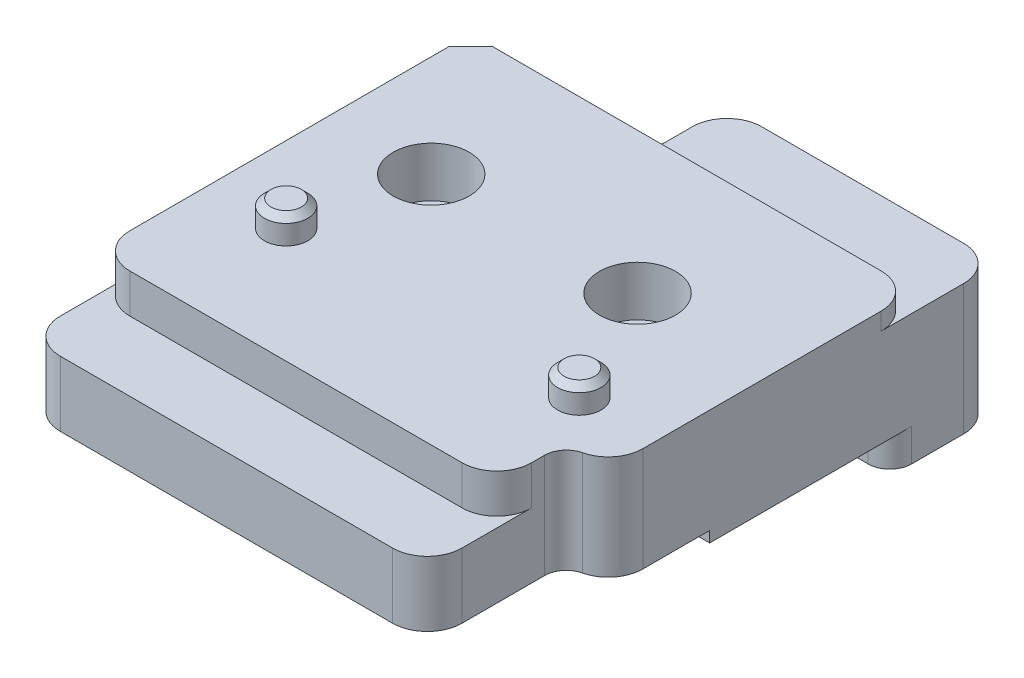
ISO-10303-21;
HEADER;
FILE_DESCRIPTION(('STEP AP214'),'2;1');
FILE_NAME('part.step','',(''),(''),'','','');
FILE_SCHEMA(('AUTOMOTIVE_DESIGN { 1 0 10303 214 1 1 1 1 }'));
ENDSEC;
DATA;
#1=APPLICATION_CONTEXT('core data for automotive mechanical design processes');
#2=APPLICATION_PROTOCOL_DEFINITION('international standard','automotive_design',2000,#1);
#3=PRODUCT_CONTEXT('',#1,'mechanical');
#4=PRODUCT('Part','Part','',(#3));
#5=PRODUCT_RELATED_PRODUCT_CATEGORY('part','',(#4));
#6=PRODUCT_DEFINITION_FORMATION('','',#4);
#7=PRODUCT_DEFINITION_CONTEXT('part definition',#1,'design');
#8=PRODUCT_DEFINITION('design','',#6,#7);
#9=PRODUCT_DEFINITION_SHAPE('','',#8);
#10=(LENGTH_UNIT() NAMED_UNIT(*) SI_UNIT(.MILLI.,.METRE.));
#11=(NAMED_UNIT(*) PLANE_ANGLE_UNIT() SI_UNIT($,.RADIAN.));
#12=(NAMED_UNIT(*) SI_UNIT($,.STERADIAN.) SOLID_ANGLE_UNIT());
#13=UNCERTAINTY_MEASURE_WITH_UNIT(LENGTH_MEASURE(1.E-05),#10,'distance_accuracy_value','');
#14=(GEOMETRIC_REPRESENTATION_CONTEXT(3) GLOBAL_UNCERTAINTY_ASSIGNED_CONTEXT((#13)) GLOBAL_UNIT_ASSIGNED_CONTEXT((#10,
#11,#12)) REPRESENTATION_CONTEXT('',''));
#15=CARTESIAN_POINT('',(0.,0.,0.));
#16=DIRECTION('',(0.,0.,1.));
#17=DIRECTION('',(1.,0.,0.));
#18=AXIS2_PLACEMENT_3D('',#15,#16,#17);
#19=CARTESIAN_POINT('',(0.,0.,19.));
#20=DIRECTION('',(0.,0.,1.));
#21=DIRECTION('',(1.,0.,0.));
#22=AXIS2_PLACEMENT_3D('',#19,#20,#21);
#23=PLANE('',#22);
#24=DIRECTION('',(-1.,0.,0.));
#25=VECTOR('',#24,1.);
#26=CARTESIAN_POINT('',(0.,3.1,19.));
#27=LINE('',#26,#25);
#28=CARTESIAN_POINT('',(10.15,3.1,19.));
#29=VERTEX_POINT('',#28);
#30=CARTESIAN_POINT('',(-5.15,3.1,19.));
#31=VERTEX_POINT('',#30);
#32=EDGE_CURVE('E666',#29,#31,#27,.T.);
#33=ORIENTED_EDGE('',*,*,#32,.T.);
#34=DIRECTION('',(0.,-1.,0.));
#35=VECTOR('',#34,1.);
#36=CARTESIAN_POINT('',(-5.15,0.,19.));
#37=LINE('',#36,#35);
#38=CARTESIAN_POINT('',(-5.15,0.1,19.));
#39=VERTEX_POINT('',#38);
#40=EDGE_CURVE('E551',#31,#39,#37,.T.);
#41=ORIENTED_EDGE('',*,*,#40,.T.);
#42=DIRECTION('',(-1.,0.,0.));
#43=VECTOR('',#42,1.);
#44=CARTESIAN_POINT('',(11.75,0.1,19.));
#45=LINE('',#44,#43);
#46=CARTESIAN_POINT('',(10.15,0.1,19.));
#47=VERTEX_POINT('',#46);
#48=EDGE_CURVE('E663',#47,#39,#45,.T.);
#49=ORIENTED_EDGE('',*,*,#48,.F.);
#50=DIRECTION('',(0.,1.,0.));
#51=VECTOR('',#50,1.);
#52=CARTESIAN_POINT('',(10.15,3.1,19.));
#53=LINE('',#52,#51);
#54=EDGE_CURVE('E548',#47,#29,#53,.T.);
#55=ORIENTED_EDGE('',*,*,#54,.T.);
#56=EDGE_LOOP('',(#33,#41,#49,#55));
#57=FACE_BOUND('',#56,.T.);
#58=ADVANCED_FACE('F35',(#57),#23,.T.);
#59=CARTESIAN_POINT('',(11.75,4.6,19.1));
#60=DIRECTION('',(-1.,0.,0.));
#61=DIRECTION('',(0.,0.,1.));
#62=AXIS2_PLACEMENT_3D('',#59,#60,#61);
#63=PLANE('',#62);
#64=DIRECTION('',(0.,0.,-1.));
#65=VECTOR('',#64,1.);
#66=CARTESIAN_POINT('',(11.75,4.9,19.));
#67=LINE('',#66,#65);
#68=CARTESIAN_POINT('',(11.75,4.9,14.2));
#69=VERTEX_POINT('',#68);
#70=CARTESIAN_POINT('',(11.75,4.9,13.6));
#71=VERTEX_POINT('',#70);
#72=EDGE_CURVE('E309',#69,#71,#67,.T.);
#73=ORIENTED_EDGE('',*,*,#72,.F.);
#74=DIRECTION('',(0.,1.,0.));
#75=VECTOR('',#74,1.);
#76=CARTESIAN_POINT('',(11.75,4.6,14.2));
#77=LINE('',#76,#75);
#78=CARTESIAN_POINT('',(11.75,3.1,14.2));
#79=VERTEX_POINT('',#78);
#80=EDGE_CURVE('E524',#69,#79,#77,.F.);
#81=ORIENTED_EDGE('',*,*,#80,.T.);
#82=DIRECTION('',(0.,0.,-1.));
#83=VECTOR('',#82,1.);
#84=CARTESIAN_POINT('',(11.75,3.1,15.8));
#85=LINE('',#84,#83);
#86=CARTESIAN_POINT('',(11.75,3.1,17.4));
#87=VERTEX_POINT('',#86);
#88=EDGE_CURVE('E695',#87,#79,#85,.T.);
#89=ORIENTED_EDGE('',*,*,#88,.F.);
#90=DIRECTION('',(0.,1.,0.));
#91=VECTOR('',#90,1.);
#92=CARTESIAN_POINT('',(11.75,0.1,17.4));
#93=LINE('',#92,#91);
#94=CARTESIAN_POINT('',(11.75,0.1,17.4));
#95=VERTEX_POINT('',#94);
#96=EDGE_CURVE('E282',#87,#95,#93,.F.);
#97=ORIENTED_EDGE('',*,*,#96,.T.);
#98=DIRECTION('',(0.,0.,1.));
#99=VECTOR('',#98,1.);
#100=CARTESIAN_POINT('',(11.75,0.1,13.6));
#101=LINE('',#100,#99);
#102=CARTESIAN_POINT('',(11.75,0.1,13.6));
#103=VERTEX_POINT('',#102);
#104=EDGE_CURVE('E260',#103,#95,#101,.T.);
#105=ORIENTED_EDGE('',*,*,#104,.F.);
#106=DIRECTION('',(0.,-1.,0.));
#107=VECTOR('',#106,1.);
#108=CARTESIAN_POINT('',(11.75,5.1,13.6));
#109=LINE('',#108,#107);
#110=EDGE_CURVE('E270',#103,#71,#109,.F.);
#111=ORIENTED_EDGE('',*,*,#110,.T.);
#112=EDGE_LOOP('',(#73,#81,#89,#97,#105,#111));
#113=FACE_BOUND('',#112,.T.);
#114=ADVANCED_FACE('F279',(#113),#63,.F.);
#115=CARTESIAN_POINT('',(12.75,4.6,13.6));
#116=DIRECTION('',(0.,1.,0.));
#117=DIRECTION('',(0.,0.,1.));
#118=AXIS2_PLACEMENT_3D('',#115,#116,#117);
#119=CYLINDRICAL_SURFACE('',#118,1.);
#120=CARTESIAN_POINT('',(12.75,0.1,13.6));
#121=DIRECTION('',(0.,1.,0.));
#122=DIRECTION('',(0.,0.,-1.));
#123=AXIS2_PLACEMENT_3D('',#120,#121,#122);
#124=CIRCLE('',#123,0.999999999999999);
#125=CARTESIAN_POINT('',(12.5192307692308,0.1,12.626991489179));
#126=VERTEX_POINT('',#125);
#127=EDGE_CURVE('E255',#126,#103,#124,.T.);
#128=ORIENTED_EDGE('',*,*,#127,.F.);
#129=DIRECTION('',(0.,1.,0.));
#130=VECTOR('',#129,1.);
#131=CARTESIAN_POINT('',(12.5192307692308,4.6,12.626991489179));
#132=LINE('',#131,#130);
#133=CARTESIAN_POINT('',(12.5192307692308,4.9,12.626991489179));
#134=VERTEX_POINT('',#133);
#135=EDGE_CURVE('E563',#126,#134,#132,.T.);
#136=ORIENTED_EDGE('',*,*,#135,.T.);
#137=CARTESIAN_POINT('',(12.75,4.9,13.6));
#138=DIRECTION('',(0.,-1.,0.));
#139=DIRECTION('',(0.,0.,1.));
#140=AXIS2_PLACEMENT_3D('',#137,#138,#139);
#141=CIRCLE('',#140,0.999999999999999);
#142=EDGE_CURVE('E273',#71,#134,#141,.T.);
#143=ORIENTED_EDGE('',*,*,#142,.F.);
#144=ORIENTED_EDGE('',*,*,#110,.F.);
#145=EDGE_LOOP('',(#128,#136,#143,#144));
#146=FACE_BOUND('',#145,.T.);
#147=ADVANCED_FACE('F271',(#146),#119,.F.);
#148=CARTESIAN_POINT('',(13.75,0.,21.8925824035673));
#149=DIRECTION('',(1.,0.,0.));
#150=DIRECTION('',(0.,0.,-1.));
#151=AXIS2_PLACEMENT_3D('',#148,#149,#150);
#152=PLANE('',#151);
#153=DIRECTION('',(0.,0.,-1.));
#154=VECTOR('',#153,1.);
#155=CARTESIAN_POINT('',(13.75,4.1,21.8925824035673));
#156=LINE('',#155,#154);
#157=CARTESIAN_POINT('',(13.75,4.1,0.1));
#158=VERTEX_POINT('',#157);
#159=CARTESIAN_POINT('',(13.75,4.1,-3.7));
#160=VERTEX_POINT('',#159);
#161=EDGE_CURVE('E368',#158,#160,#156,.T.);
#162=ORIENTED_EDGE('',*,*,#161,.F.);
#163=DIRECTION('',(0.,-1.,0.));
#164=VECTOR('',#163,1.);
#165=CARTESIAN_POINT('',(13.75,0.,0.0999999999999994));
#166=LINE('',#165,#164);
#167=CARTESIAN_POINT('',(13.75,4.9,0.0999999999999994));
#168=VERTEX_POINT('',#167);
#169=EDGE_CURVE('E508',#158,#168,#166,.F.);
#170=ORIENTED_EDGE('',*,*,#169,.T.);
#171=DIRECTION('',(0.,0.,-1.));
#172=VECTOR('',#171,1.);
#173=CARTESIAN_POINT('',(13.75,4.9,12.6));
#174=LINE('',#173,#172);
#175=CARTESIAN_POINT('',(13.75,4.9,11.0701778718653));
#176=VERTEX_POINT('',#175);
#177=EDGE_CURVE('E312',#176,#168,#174,.T.);
#178=ORIENTED_EDGE('',*,*,#177,.F.);
#179=DIRECTION('',(0.,-1.,0.));
#180=VECTOR('',#179,1.);
#181=CARTESIAN_POINT('',(13.75,0.1,11.0701778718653));
#182=LINE('',#181,#180);
#183=CARTESIAN_POINT('',(13.75,0.1,11.0701778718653));
#184=VERTEX_POINT('',#183);
#185=EDGE_CURVE('E503',#176,#184,#182,.T.);
#186=ORIENTED_EDGE('',*,*,#185,.T.);
#187=DIRECTION('',(0.,0.,1.));
#188=VECTOR('',#187,1.);
#189=CARTESIAN_POINT('',(13.75,0.1,8.));
#190=LINE('',#189,#188);
#191=CARTESIAN_POINT('',(13.75,0.1,8.));
#192=VERTEX_POINT('',#191);
#193=EDGE_CURVE('E266',#192,#184,#190,.T.);
#194=ORIENTED_EDGE('',*,*,#193,.F.);
#195=DIRECTION('',(0.,-1.,0.));
#196=VECTOR('',#195,1.);
#197=CARTESIAN_POINT('',(13.75,0.6,8.));
#198=LINE('',#197,#196);
#199=CARTESIAN_POINT('',(13.75,-0.4,8.));
#200=VERTEX_POINT('',#199);
#201=EDGE_CURVE('E286',#192,#200,#198,.T.);
#202=ORIENTED_EDGE('',*,*,#201,.T.);
#203=DIRECTION('',(0.,0.,1.));
#204=VECTOR('',#203,1.);
#205=CARTESIAN_POINT('',(13.75,-0.4,6.2));
#206=LINE('',#205,#204);
#207=CARTESIAN_POINT('',(13.75,-0.4,-1.3));
#208=VERTEX_POINT('',#207);
#209=EDGE_CURVE('E358',#208,#200,#206,.T.);
#210=ORIENTED_EDGE('',*,*,#209,.F.);
#211=DIRECTION('',(0.,1.,0.));
#212=VECTOR('',#211,1.);
#213=CARTESIAN_POINT('',(13.75,-1.9,-1.3));
#214=LINE('',#213,#212);
#215=CARTESIAN_POINT('',(13.75,-1.9,-1.3));
#216=VERTEX_POINT('',#215);
#217=EDGE_CURVE('E483',#208,#216,#214,.F.);
#218=ORIENTED_EDGE('',*,*,#217,.T.);
#219=DIRECTION('',(0.,0.,1.));
#220=VECTOR('',#219,1.);
#221=CARTESIAN_POINT('',(13.75,-1.9,-5.8));
#222=LINE('',#221,#220);
#223=CARTESIAN_POINT('',(13.75,-1.9,-3.7));
#224=VERTEX_POINT('',#223);
#225=EDGE_CURVE('E398',#224,#216,#222,.T.);
#226=ORIENTED_EDGE('',*,*,#225,.F.);
#227=DIRECTION('',(0.,-1.,0.));
#228=VECTOR('',#227,1.);
#229=CARTESIAN_POINT('',(13.75,0.,-3.7));
#230=LINE('',#229,#228);
#231=EDGE_CURVE('E506',#224,#160,#230,.F.);
#232=ORIENTED_EDGE('',*,*,#231,.T.);
#233=EDGE_LOOP('',(#162,#170,#178,#186,#194,#202,#210,#218,#226,#232));
#234=FACE_BOUND('',#233,.T.);
#235=ADVANCED_FACE('F680',(#234),#152,.T.);
#236=CARTESIAN_POINT('',(1.25,1.5,-2.5));
#237=DIRECTION('',(-1.,0.,0.));
#238=DIRECTION('',(0.,0.,1.));
#239=AXIS2_PLACEMENT_3D('',#236,#237,#238);
#240=PLANE('',#239);
#241=DIRECTION('',(0.,0.,1.));
#242=VECTOR('',#241,1.);
#243=CARTESIAN_POINT('',(1.25,4.1,-2.5));
#244=LINE('',#243,#242);
#245=CARTESIAN_POINT('',(1.25,4.1,-3.7));
#246=VERTEX_POINT('',#245);
#247=CARTESIAN_POINT('',(1.25,4.1,-2.5));
#248=VERTEX_POINT('',#247);
#249=EDGE_CURVE('E366',#246,#248,#244,.T.);
#250=ORIENTED_EDGE('',*,*,#249,.F.);
#251=DIRECTION('',(0.,1.,0.));
#252=VECTOR('',#251,1.);
#253=CARTESIAN_POINT('',(1.25,1.5,-3.7));
#254=LINE('',#253,#252);
#255=CARTESIAN_POINT('',(1.25,-1.9,-3.7));
#256=VERTEX_POINT('',#255);
#257=EDGE_CURVE('E544',#246,#256,#254,.F.);
#258=ORIENTED_EDGE('',*,*,#257,.T.);
#259=DIRECTION('',(0.,0.,-1.));
#260=VECTOR('',#259,1.);
#261=CARTESIAN_POINT('',(1.25,-1.9,-5.8));
#262=LINE('',#261,#260);
#263=CARTESIAN_POINT('',(1.25,-1.9,-1.3));
#264=VERTEX_POINT('',#263);
#265=EDGE_CURVE('E403',#264,#256,#262,.T.);
#266=ORIENTED_EDGE('',*,*,#265,.F.);
#267=DIRECTION('',(0.,1.,0.));
#268=VECTOR('',#267,1.);
#269=CARTESIAN_POINT('',(1.25,-0.400000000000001,-1.3));
#270=LINE('',#269,#268);
#271=CARTESIAN_POINT('',(1.25,-0.400000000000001,-1.3));
#272=VERTEX_POINT('',#271);
#273=EDGE_CURVE('E488',#264,#272,#270,.T.);
#274=ORIENTED_EDGE('',*,*,#273,.T.);
#275=DIRECTION('',(0.,0.,1.));
#276=VECTOR('',#275,1.);
#277=CARTESIAN_POINT('',(1.25,-0.400000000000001,-2.5));
#278=LINE('',#277,#276);
#279=CARTESIAN_POINT('',(1.25,-0.400000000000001,-2.5));
#280=VERTEX_POINT('',#279);
#281=EDGE_CURVE('E355',#280,#272,#278,.T.);
#282=ORIENTED_EDGE('',*,*,#281,.F.);
#283=DIRECTION('',(0.,-1.,0.));
#284=VECTOR('',#283,1.);
#285=CARTESIAN_POINT('',(1.25,4.1,-2.5));
#286=LINE('',#285,#284);
#287=EDGE_CURVE('E277',#280,#248,#286,.F.);
#288=ORIENTED_EDGE('',*,*,#287,.T.);
#289=EDGE_LOOP('',(#250,#258,#266,#274,#282,#288));
#290=FACE_BOUND('',#289,.T.);
#291=ADVANCED_FACE('F765',(#290),#240,.T.);
#292=CARTESIAN_POINT('',(0.,-1.9,0.));
#293=DIRECTION('',(0.,-1.,0.));
#294=DIRECTION('',(0.,0.,-1.));
#295=AXIS2_PLACEMENT_3D('',#292,#293,#294);
#296=PLANE('',#295);
#297=DIRECTION('',(-1.,0.,0.));
#298=VECTOR('',#297,1.);
#299=CARTESIAN_POINT('',(13.75,-1.9,-5.3));
#300=LINE('',#299,#298);
#301=CARTESIAN_POINT('',(12.15,-1.9,-5.3));
#302=VERTEX_POINT('',#301);
#303=CARTESIAN_POINT('',(10.3099491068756,-1.9,-5.3));
#304=VERTEX_POINT('',#303);
#305=EDGE_CURVE('E296',#302,#304,#300,.T.);
#306=ORIENTED_EDGE('',*,*,#305,.F.);
#307=CARTESIAN_POINT('',(12.15,-1.9,-3.7));
#308=DIRECTION('',(0.,-1.,0.));
#309=DIRECTION('',(0.,0.,-1.));
#310=AXIS2_PLACEMENT_3D('',#307,#308,#309);
#311=CIRCLE('',#310,1.6);
#312=EDGE_CURVE('E538',#302,#224,#311,.T.);
#313=ORIENTED_EDGE('',*,*,#312,.T.);
#314=ORIENTED_EDGE('',*,*,#225,.T.);
#315=CARTESIAN_POINT('',(12.75,-1.9,-1.3));
#316=DIRECTION('',(0.,-1.,0.));
#317=DIRECTION('',(0.,0.,-1.));
#318=AXIS2_PLACEMENT_3D('',#315,#316,#317);
#319=CIRCLE('',#318,1.);
#320=CARTESIAN_POINT('',(12.75,-1.9,-0.3));
#321=VERTEX_POINT('',#320);
#322=EDGE_CURVE('E486',#216,#321,#319,.T.);
#323=ORIENTED_EDGE('',*,*,#322,.T.);
#324=DIRECTION('',(-1.,0.,0.));
#325=VECTOR('',#324,1.);
#326=CARTESIAN_POINT('',(13.75,-1.9,-0.3));
#327=LINE('',#326,#325);
#328=CARTESIAN_POINT('',(10.3099491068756,-1.9,-0.300000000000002));
#329=VERTEX_POINT('',#328);
#330=EDGE_CURVE('E401',#321,#329,#327,.T.);
#331=ORIENTED_EDGE('',*,*,#330,.T.);
#332=DIRECTION('',(0.,0.,1.));
#333=VECTOR('',#332,1.);
#334=CARTESIAN_POINT('',(10.3099491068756,-1.9,-5.8));
#335=LINE('',#334,#333);
#336=EDGE_CURVE('E421',#304,#329,#335,.T.);
#337=ORIENTED_EDGE('',*,*,#336,.F.);
#338=EDGE_LOOP('',(#306,#313,#314,#323,#331,#337));
#339=FACE_BOUND('',#338,.T.);
#340=ADVANCED_FACE('F782',(#339),#296,.T.);
#341=ORIENTED_EDGE('',*,*,#265,.T.);
#342=CARTESIAN_POINT('',(2.85,-1.9,-3.7));
#343=DIRECTION('',(0.,-1.,0.));
#344=DIRECTION('',(0.,0.,-1.));
#345=AXIS2_PLACEMENT_3D('',#342,#343,#344);
#346=CIRCLE('',#345,1.6);
#347=CARTESIAN_POINT('',(2.85,-1.9,-5.3));
#348=VERTEX_POINT('',#347);
#349=EDGE_CURVE('E546',#256,#348,#346,.T.);
#350=ORIENTED_EDGE('',*,*,#349,.T.);
#351=DIRECTION('',(-1.,0.,0.));
#352=VECTOR('',#351,1.);
#353=CARTESIAN_POINT('',(3.38174587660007,-1.9,-5.3));
#354=LINE('',#353,#352);
#355=CARTESIAN_POINT('',(3.38174587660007,-1.9,-5.3));
#356=VERTEX_POINT('',#355);
#357=EDGE_CURVE('E300',#356,#348,#354,.T.);
#358=ORIENTED_EDGE('',*,*,#357,.F.);
#359=DIRECTION('',(0.,0.,1.));
#360=VECTOR('',#359,1.);
#361=CARTESIAN_POINT('',(3.38174587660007,-1.9,-5.8));
#362=LINE('',#361,#360);
#363=CARTESIAN_POINT('',(3.38174587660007,-1.9,-0.300000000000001));
#364=VERTEX_POINT('',#363);
#365=EDGE_CURVE('E418',#364,#356,#362,.F.);
#366=ORIENTED_EDGE('',*,*,#365,.F.);
#367=CARTESIAN_POINT('',(2.25,-1.9,-0.300000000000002));
#368=VERTEX_POINT('',#367);
#369=EDGE_CURVE('E400',#364,#368,#327,.T.);
#370=ORIENTED_EDGE('',*,*,#369,.T.);
#371=CARTESIAN_POINT('',(2.25,-1.9,-1.3));
#372=DIRECTION('',(0.,-1.,0.));
#373=DIRECTION('',(0.,0.,-1.));
#374=AXIS2_PLACEMENT_3D('',#371,#372,#373);
#375=CIRCLE('',#374,1.);
#376=EDGE_CURVE('E493',#368,#264,#375,.T.);
#377=ORIENTED_EDGE('',*,*,#376,.T.);
#378=EDGE_LOOP('',(#341,#350,#358,#366,#370,#377));
#379=FACE_BOUND('',#378,.T.);
#380=ADVANCED_FACE('F648',(#379),#296,.T.);
#381=CARTESIAN_POINT('',(6.84584749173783,-2.39999999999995,-5.8));
#382=DIRECTION('',(0.,0.,1.));
#383=DIRECTION('',(1.,0.,0.));
#384=AXIS2_PLACEMENT_3D('',#381,#382,#383);
#385=CYLINDRICAL_SURFACE('',#384,3.5);
#386=DIRECTION('',(0.,0.,1.));
#387=VECTOR('',#386,1.);
#388=CARTESIAN_POINT('',(7.34584749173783,1.0641016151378,-5.8));
#389=LINE('',#388,#387);
#390=CARTESIAN_POINT('',(7.34584749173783,1.0641016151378,-1.05));
#391=VERTEX_POINT('',#390);
#392=CARTESIAN_POINT('',(7.34584749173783,1.0641016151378,-4.05));
#393=VERTEX_POINT('',#392);
#394=EDGE_CURVE('E424',#391,#393,#389,.F.);
#395=ORIENTED_EDGE('',*,*,#394,.T.);
#396=CARTESIAN_POINT('',(7.34584749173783,1.0641016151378,-4.05));
#397=CARTESIAN_POINT('',(7.34587205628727,1.06408841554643,-4.07797686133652));
#398=CARTESIAN_POINT('',(7.34350092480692,1.06444017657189,-4.10594332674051));
#399=CARTESIAN_POINT('',(7.33415239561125,1.06577526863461,-4.16104821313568));
#400=CARTESIAN_POINT('',(7.32718033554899,1.06675786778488,-4.1881875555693));
#401=CARTESIAN_POINT('',(7.30881167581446,1.0692570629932,-4.24090684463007));
#402=CARTESIAN_POINT('',(7.29741381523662,1.07077381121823,-4.26648634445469));
#403=CARTESIAN_POINT('',(7.27053157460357,1.0741657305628,-4.31536967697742));
#404=CARTESIAN_POINT('',(7.25504736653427,1.07604088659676,-4.33867360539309));
#405=CARTESIAN_POINT('',(7.2203118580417,1.07995439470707,-4.38251106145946));
#406=CARTESIAN_POINT('',(7.20103708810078,1.0819937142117,-4.40302590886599));
#407=CARTESIAN_POINT('',(7.15931645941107,1.08599708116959,-4.44054367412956));
#408=CARTESIAN_POINT('',(7.13687011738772,1.08796111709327,-4.45754605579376));
#409=CARTESIAN_POINT('',(7.08932439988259,1.09160264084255,-4.4876227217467));
#410=CARTESIAN_POINT('',(7.06421396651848,1.09327885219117,-4.50067969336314));
#411=CARTESIAN_POINT('',(7.01213009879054,1.09614494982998,-4.52238318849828));
#412=CARTESIAN_POINT('',(6.98515686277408,1.0973348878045,-4.53103018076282));
#413=CARTESIAN_POINT('',(6.93030633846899,1.09908761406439,-4.54361222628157));
#414=CARTESIAN_POINT('',(6.90243644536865,1.09965461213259,-4.5475789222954));
#415=CARTESIAN_POINT('',(6.8464205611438,1.10011199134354,-4.55078599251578));
#416=CARTESIAN_POINT('',(6.81827457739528,1.10000239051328,-4.55002649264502));
#417=CARTESIAN_POINT('',(6.76272266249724,1.09912227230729,-4.5438276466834));
#418=CARTESIAN_POINT('',(6.73531283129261,1.09835658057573,-4.53842246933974));
#419=CARTESIAN_POINT('',(6.68179344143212,1.09625570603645,-4.52313930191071));
#420=CARTESIAN_POINT('',(6.65568390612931,1.09492051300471,-4.51326123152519));
#421=CARTESIAN_POINT('',(6.6054014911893,1.09182231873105,-4.48927707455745));
#422=CARTESIAN_POINT('',(6.5812356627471,1.09005784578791,-4.47515640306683));
#423=CARTESIAN_POINT('',(6.53560467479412,1.08629808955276,-4.44309914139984));
#424=CARTESIAN_POINT('',(6.51413956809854,1.08430280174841,-4.4251624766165));
#425=CARTESIAN_POINT('',(6.47431958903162,1.08028328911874,-4.38579422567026));
#426=CARTESIAN_POINT('',(6.45599374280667,1.07825896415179,-4.36433327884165));
#427=CARTESIAN_POINT('',(6.42319427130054,1.07442630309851,-4.31861819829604));
#428=CARTESIAN_POINT('',(6.40872177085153,1.07261803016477,-4.29436325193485));
#429=CARTESIAN_POINT('',(6.38403498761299,1.0694213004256,-4.24371216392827));
#430=CARTESIAN_POINT('',(6.37382600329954,1.06803336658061,-4.21731340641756));
#431=CARTESIAN_POINT('',(6.35801399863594,1.06584566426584,-4.16318333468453));
#432=CARTESIAN_POINT('',(6.35240406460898,1.06504501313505,-4.13545408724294));
#433=CARTESIAN_POINT('',(6.34694973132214,1.06426000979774,-4.08838517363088));
#434=CARTESIAN_POINT('',(6.3458376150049,1.06409681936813,-4.06918837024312));
#435=CARTESIAN_POINT('',(6.34584749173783,1.0641016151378,-4.05));
#436=B_SPLINE_CURVE_WITH_KNOTS('',3,(#396,#397,#398,#399,#400,#401,#402,#403,#404,#405,#406,
#407,#408,#409,#410,#411,#412,#413,#414,#415,#416,#417,#418,#419,#420,#421,#422,#423,#424,#425,
#426,#427,#428,#429,#430,#431,#432,#433,#434,#435),.UNSPECIFIED.,.F.,.F.,(4,2,2,2,2,2,2,2,2,2,2,
2,2,2,2,2,2,2,2,4),(0.,0.0838126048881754,0.167528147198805,0.251267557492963,0.335003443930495,
0.419275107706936,0.503559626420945,0.588208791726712,0.672848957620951,0.756913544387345,
0.840975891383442,0.924425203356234,1.00787601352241,1.09161705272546,1.1753597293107,
1.25983919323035,1.34434329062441,1.42895209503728,1.51343347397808,1.57098907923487),.UNSPECIFIED.);
#437=CARTESIAN_POINT('',(6.34584749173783,1.0641016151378,-4.05));
#438=VERTEX_POINT('',#437);
#439=EDGE_CURVE('E458',#393,#438,#436,.T.);
#440=ORIENTED_EDGE('',*,*,#439,.T.);
#441=DIRECTION('',(0.,0.,1.));
#442=VECTOR('',#441,1.);
#443=CARTESIAN_POINT('',(6.34584749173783,1.0641016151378,-5.8));
#444=LINE('',#443,#442);
#445=CARTESIAN_POINT('',(6.34584749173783,1.0641016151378,-1.05));
#446=VERTEX_POINT('',#445);
#447=EDGE_CURVE('E435',#438,#446,#444,.T.);
#448=ORIENTED_EDGE('',*,*,#447,.T.);
#449=CARTESIAN_POINT('',(6.34584749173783,1.0641016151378,-1.05));
#450=CARTESIAN_POINT('',(6.34582292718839,1.06408841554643,-1.02202313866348));
#451=CARTESIAN_POINT('',(6.34819405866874,1.06444017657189,-0.994056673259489));
#452=CARTESIAN_POINT('',(6.35754258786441,1.06577526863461,-0.93895178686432));
#453=CARTESIAN_POINT('',(6.36451464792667,1.06675786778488,-0.911812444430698));
#454=CARTESIAN_POINT('',(6.3828833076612,1.0692570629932,-0.859093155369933));
#455=CARTESIAN_POINT('',(6.39428116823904,1.07077381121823,-0.833513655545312));
#456=CARTESIAN_POINT('',(6.42116340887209,1.0741657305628,-0.784630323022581));
#457=CARTESIAN_POINT('',(6.43664761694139,1.07604088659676,-0.761326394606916));
#458=CARTESIAN_POINT('',(6.47138312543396,1.07995439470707,-0.717488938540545));
#459=CARTESIAN_POINT('',(6.49065789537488,1.0819937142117,-0.69697409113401));
#460=CARTESIAN_POINT('',(6.53237852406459,1.08599708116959,-0.65945632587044));
#461=CARTESIAN_POINT('',(6.55482486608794,1.08796111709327,-0.642453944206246));
#462=CARTESIAN_POINT('',(6.60237058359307,1.09160264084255,-0.612377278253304));
#463=CARTESIAN_POINT('',(6.62748101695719,1.09327885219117,-0.599320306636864));
#464=CARTESIAN_POINT('',(6.67956488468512,1.09614494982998,-0.577616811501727));
#465=CARTESIAN_POINT('',(6.70653812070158,1.09733488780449,-0.568969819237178));
#466=CARTESIAN_POINT('',(6.76138864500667,1.09908761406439,-0.556387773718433));
#467=CARTESIAN_POINT('',(6.78925853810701,1.09965461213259,-0.552421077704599));
#468=CARTESIAN_POINT('',(6.84527442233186,1.10011199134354,-0.549214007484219));
#469=CARTESIAN_POINT('',(6.87342040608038,1.10000239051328,-0.549973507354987));
#470=CARTESIAN_POINT('',(6.92897232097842,1.09912227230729,-0.5561723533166));
#471=CARTESIAN_POINT('',(6.95638215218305,1.09835658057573,-0.561577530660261));
#472=CARTESIAN_POINT('',(7.00990154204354,1.09625570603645,-0.57686069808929));
#473=CARTESIAN_POINT('',(7.03601107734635,1.09492051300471,-0.586738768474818));
#474=CARTESIAN_POINT('',(7.08629349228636,1.09182231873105,-0.610722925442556));
#475=CARTESIAN_POINT('',(7.11045932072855,1.09005784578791,-0.624843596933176));
#476=CARTESIAN_POINT('',(7.15609030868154,1.08629808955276,-0.656900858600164));
#477=CARTESIAN_POINT('',(7.17755541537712,1.08430280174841,-0.674837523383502));
#478=CARTESIAN_POINT('',(7.21737539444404,1.08028328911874,-0.714205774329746));
#479=CARTESIAN_POINT('',(7.23570124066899,1.07825896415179,-0.735666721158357));
#480=CARTESIAN_POINT('',(7.26850071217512,1.07442630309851,-0.781381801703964));
#481=CARTESIAN_POINT('',(7.28297321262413,1.07261803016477,-0.805636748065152));
#482=CARTESIAN_POINT('',(7.30765999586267,1.0694213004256,-0.856287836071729));
#483=CARTESIAN_POINT('',(7.31786898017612,1.06803336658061,-0.882686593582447));
#484=CARTESIAN_POINT('',(7.33368098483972,1.06584566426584,-0.936816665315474));
#485=CARTESIAN_POINT('',(7.33929091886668,1.06504501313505,-0.964545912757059));
#486=CARTESIAN_POINT('',(7.34474525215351,1.06426000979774,-1.01161482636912));
#487=CARTESIAN_POINT('',(7.34585736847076,1.06409681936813,-1.03081162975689));
#488=CARTESIAN_POINT('',(7.34584749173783,1.0641016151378,-1.05));
#489=B_SPLINE_CURVE_WITH_KNOTS('',3,(#449,#450,#451,#452,#453,#454,#455,#456,#457,#458,#459,
#460,#461,#462,#463,#464,#465,#466,#467,#468,#469,#470,#471,#472,#473,#474,#475,#476,#477,#478,
#479,#480,#481,#482,#483,#484,#485,#486,#487,#488),.UNSPECIFIED.,.F.,.F.,(4,2,2,2,2,2,2,2,2,2,2,
2,2,2,2,2,2,2,2,4),(0.,0.0838126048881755,0.167528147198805,0.251267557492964,0.335003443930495,
0.419275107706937,0.503559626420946,0.588208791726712,0.67284895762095,0.756913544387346,
0.840975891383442,0.924425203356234,1.00787601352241,1.09161705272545,1.1753597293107,
1.25983919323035,1.34434329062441,1.42895209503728,1.51343347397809,1.57098907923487),.UNSPECIFIED.);
#490=EDGE_CURVE('E427',#446,#391,#489,.T.);
#491=ORIENTED_EDGE('',*,*,#490,.T.);
#492=EDGE_LOOP('',(#395,#440,#448,#491));
#493=FACE_BOUND('',#492,.T.);
#494=CARTESIAN_POINT('',(6.84584749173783,-2.39999999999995,-0.300000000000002));
#495=DIRECTION('',(0.,0.,1.));
#496=DIRECTION('',(1.,0.,0.));
#497=AXIS2_PLACEMENT_3D('',#494,#495,#496);
#498=CIRCLE('',#497,3.5);
#499=CARTESIAN_POINT('',(9.71812881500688,-0.400000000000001,-0.300000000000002));
#500=VERTEX_POINT('',#499);
#501=EDGE_CURVE('E395',#329,#500,#498,.T.);
#502=ORIENTED_EDGE('',*,*,#501,.T.);
#503=CARTESIAN_POINT('',(6.84584749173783,-2.39999999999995,-0.300000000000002));
#504=DIRECTION('',(0.,0.,-1.));
#505=DIRECTION('',(-1.,0.,0.));
#506=AXIS2_PLACEMENT_3D('',#503,#504,#505);
#507=CIRCLE('',#506,3.5);
#508=CARTESIAN_POINT('',(3.97356616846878,-0.400000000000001,-0.300000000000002));
#509=VERTEX_POINT('',#508);
#510=EDGE_CURVE('E652',#509,#500,#507,.T.);
#511=ORIENTED_EDGE('',*,*,#510,.F.);
#512=EDGE_CURVE('E387',#509,#364,#498,.T.);
#513=ORIENTED_EDGE('',*,*,#512,.T.);
#514=ORIENTED_EDGE('',*,*,#365,.T.);
#515=CARTESIAN_POINT('',(6.84584749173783,-2.39999999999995,-5.3));
#516=DIRECTION('',(0.,0.,1.));
#517=DIRECTION('',(-1.,0.,0.));
#518=AXIS2_PLACEMENT_3D('',#515,#516,#517);
#519=CIRCLE('',#518,3.5);
#520=EDGE_CURVE('E298',#304,#356,#519,.T.);
#521=ORIENTED_EDGE('',*,*,#520,.F.);
#522=ORIENTED_EDGE('',*,*,#336,.T.);
#523=EDGE_LOOP('',(#502,#511,#513,#514,#521,#522));
#524=FACE_BOUND('',#523,.T.);
#525=ADVANCED_FACE('F437',(#493,#524),#385,.F.);
#526=CARTESIAN_POINT('',(0.,4.1,0.));
#527=DIRECTION('',(0.,-1.,0.));
#528=DIRECTION('',(0.,0.,-1.));
#529=AXIS2_PLACEMENT_3D('',#526,#527,#528);
#530=PLANE('',#529);
#531=ORIENTED_EDGE('',*,*,#161,.T.);
#532=CARTESIAN_POINT('',(12.15,4.1,-3.7));
#533=DIRECTION('',(0.,-1.,0.));
#534=DIRECTION('',(0.,0.,-1.));
#535=AXIS2_PLACEMENT_3D('',#532,#533,#534);
#536=CIRCLE('',#535,1.6);
#537=CARTESIAN_POINT('',(12.15,4.1,-5.3));
#538=VERTEX_POINT('',#537);
#539=EDGE_CURVE('E542',#160,#538,#536,.F.);
#540=ORIENTED_EDGE('',*,*,#539,.T.);
#541=DIRECTION('',(1.,0.,0.));
#542=VECTOR('',#541,1.);
#543=CARTESIAN_POINT('',(1.25,4.1,-5.3));
#544=LINE('',#543,#542);
#545=CARTESIAN_POINT('',(2.85,4.1,-5.3));
#546=VERTEX_POINT('',#545);
#547=EDGE_CURVE('E293',#546,#538,#544,.T.);
#548=ORIENTED_EDGE('',*,*,#547,.F.);
#549=CARTESIAN_POINT('',(2.85,4.1,-3.7));
#550=DIRECTION('',(0.,-1.,0.));
#551=DIRECTION('',(0.,0.,-1.));
#552=AXIS2_PLACEMENT_3D('',#549,#550,#551);
#553=CIRCLE('',#552,1.6);
#554=EDGE_CURVE('E540',#546,#246,#553,.F.);
#555=ORIENTED_EDGE('',*,*,#554,.T.);
#556=ORIENTED_EDGE('',*,*,#249,.T.);
#557=CARTESIAN_POINT('',(0.249999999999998,4.1,-2.5));
#558=DIRECTION('',(0.,-1.,0.));
#559=DIRECTION('',(0.,0.,-1.));
#560=AXIS2_PLACEMENT_3D('',#557,#558,#559);
#561=CIRCLE('',#560,1.);
#562=CARTESIAN_POINT('',(0.249999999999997,4.1,-1.5));
#563=VERTEX_POINT('',#562);
#564=EDGE_CURVE('E471',#248,#563,#561,.T.);
#565=ORIENTED_EDGE('',*,*,#564,.T.);
#566=DIRECTION('',(-1.,0.,0.));
#567=VECTOR('',#566,1.);
#568=CARTESIAN_POINT('',(13.75,4.1,-1.5));
#569=LINE('',#568,#567);
#570=CARTESIAN_POINT('',(12.15,4.1,-1.5));
#571=VERTEX_POINT('',#570);
#572=EDGE_CURVE('E352',#571,#563,#569,.T.);
#573=ORIENTED_EDGE('',*,*,#572,.F.);
#574=CARTESIAN_POINT('',(12.15,4.1,0.1));
#575=DIRECTION('',(0.,-1.,0.));
#576=DIRECTION('',(0.,0.,-1.));
#577=AXIS2_PLACEMENT_3D('',#574,#575,#576);
#578=CIRCLE('',#577,1.6);
#579=EDGE_CURVE('E565',#571,#158,#578,.T.);
#580=ORIENTED_EDGE('',*,*,#579,.T.);
#581=EDGE_LOOP('',(#531,#540,#548,#555,#556,#565,#573,#580));
#582=FACE_BOUND('',#581,.T.);
#583=ADVANCED_FACE('F593',(#582),#530,.F.);
#584=CARTESIAN_POINT('',(-6.74999999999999,0.,0.));
#585=DIRECTION('',(-1.,0.,0.));
#586=DIRECTION('',(0.,0.,1.));
#587=AXIS2_PLACEMENT_3D('',#584,#585,#586);
#588=PLANE('',#587);
#589=DIRECTION('',(0.,0.,1.));
#590=VECTOR('',#589,1.);
#591=CARTESIAN_POINT('',(-6.74999999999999,4.9,-1.5));
#592=LINE('',#591,#590);
#593=CARTESIAN_POINT('',(-6.74999999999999,4.9,-0.499999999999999));
#594=VERTEX_POINT('',#593);
#595=CARTESIAN_POINT('',(-6.75,4.9,14.2));
#596=VERTEX_POINT('',#595);
#597=EDGE_CURVE('E317',#594,#596,#592,.T.);
#598=ORIENTED_EDGE('',*,*,#597,.F.);
#599=DIRECTION('',(0.,-1.,0.));
#600=VECTOR('',#599,1.);
#601=CARTESIAN_POINT('',(-6.74999999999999,0.,-0.499999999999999));
#602=LINE('',#601,#600);
#603=CARTESIAN_POINT('',(-6.75,-0.4,-0.499999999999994));
#604=VERTEX_POINT('',#603);
#605=EDGE_CURVE('E43',#594,#604,#602,.T.);
#606=ORIENTED_EDGE('',*,*,#605,.T.);
#607=DIRECTION('',(0.,0.,-1.));
#608=VECTOR('',#607,1.);
#609=CARTESIAN_POINT('',(-6.75,-0.4,19.1));
#610=LINE('',#609,#608);
#611=CARTESIAN_POINT('',(-6.75,-0.4,8.));
#612=VERTEX_POINT('',#611);
#613=EDGE_CURVE('E364',#612,#604,#610,.T.);
#614=ORIENTED_EDGE('',*,*,#613,.F.);
#615=DIRECTION('',(0.,-1.,0.));
#616=VECTOR('',#615,1.);
#617=CARTESIAN_POINT('',(-6.75,0.,8.));
#618=LINE('',#617,#616);
#619=CARTESIAN_POINT('',(-6.75,0.1,8.));
#620=VERTEX_POINT('',#619);
#621=EDGE_CURVE('E291',#620,#612,#618,.T.);
#622=ORIENTED_EDGE('',*,*,#621,.F.);
#623=DIRECTION('',(0.,0.,-1.));
#624=VECTOR('',#623,1.);
#625=CARTESIAN_POINT('',(-6.75,0.1,19.));
#626=LINE('',#625,#624);
#627=CARTESIAN_POINT('',(-6.74999999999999,0.1,17.4));
#628=VERTEX_POINT('',#627);
#629=EDGE_CURVE('E673',#628,#620,#626,.T.);
#630=ORIENTED_EDGE('',*,*,#629,.F.);
#631=DIRECTION('',(0.,-1.,0.));
#632=VECTOR('',#631,1.);
#633=CARTESIAN_POINT('',(-6.75,0.,17.4));
#634=LINE('',#633,#632);
#635=CARTESIAN_POINT('',(-6.74999999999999,3.1,17.4));
#636=VERTEX_POINT('',#635);
#637=EDGE_CURVE('E527',#628,#636,#634,.F.);
#638=ORIENTED_EDGE('',*,*,#637,.T.);
#639=DIRECTION('',(0.,0.,1.));
#640=VECTOR('',#639,1.);
#641=CARTESIAN_POINT('',(-6.74999999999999,3.1,15.8));
#642=LINE('',#641,#640);
#643=CARTESIAN_POINT('',(-6.74999999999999,3.1,14.2));
#644=VERTEX_POINT('',#643);
#645=EDGE_CURVE('E701',#644,#636,#642,.T.);
#646=ORIENTED_EDGE('',*,*,#645,.F.);
#647=DIRECTION('',(0.,1.,0.));
#648=VECTOR('',#647,1.);
#649=CARTESIAN_POINT('',(-6.75,4.9,14.2));
#650=LINE('',#649,#648);
#651=EDGE_CURVE('E529',#644,#596,#650,.T.);
#652=ORIENTED_EDGE('',*,*,#651,.T.);
#653=EDGE_LOOP('',(#598,#606,#614,#622,#630,#638,#646,#652));
#654=FACE_BOUND('',#653,.T.);
#655=ADVANCED_FACE('F626',(#654),#588,.T.);
#656=CARTESIAN_POINT('',(0.,0.,-1.5));
#657=DIRECTION('',(0.,0.,-1.));
#658=DIRECTION('',(-1.,0.,0.));
#659=AXIS2_PLACEMENT_3D('',#656,#657,#658);
#660=PLANE('',#659);
#661=DIRECTION('',(-1.,0.,0.));
#662=VECTOR('',#661,1.);
#663=CARTESIAN_POINT('',(1.25,-0.400000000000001,-1.5));
#664=LINE('',#663,#662);
#665=CARTESIAN_POINT('',(0.249999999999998,-0.400000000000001,-1.5));
#666=VERTEX_POINT('',#665);
#667=CARTESIAN_POINT('',(-5.75,-0.400000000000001,-1.5));
#668=VERTEX_POINT('',#667);
#669=EDGE_CURVE('E349',#666,#668,#664,.T.);
#670=ORIENTED_EDGE('',*,*,#669,.T.);
#671=DIRECTION('',(0.,1.,0.));
#672=VECTOR('',#671,1.);
#673=CARTESIAN_POINT('',(-5.75,0.,-1.5));
#674=LINE('',#673,#672);
#675=CARTESIAN_POINT('',(-5.75,4.9,-1.5));
#676=VERTEX_POINT('',#675);
#677=EDGE_CURVE('E573',#668,#676,#674,.T.);
#678=ORIENTED_EDGE('',*,*,#677,.T.);
#679=DIRECTION('',(-1.,0.,0.));
#680=VECTOR('',#679,1.);
#681=CARTESIAN_POINT('',(13.75,4.9,-1.5));
#682=LINE('',#681,#680);
#683=CARTESIAN_POINT('',(12.15,4.9,-1.5));
#684=VERTEX_POINT('',#683);
#685=EDGE_CURVE('E315',#684,#676,#682,.T.);
#686=ORIENTED_EDGE('',*,*,#685,.F.);
#687=DIRECTION('',(0.,-1.,0.));
#688=VECTOR('',#687,1.);
#689=CARTESIAN_POINT('',(12.15,0.,-1.5));
#690=LINE('',#689,#688);
#691=EDGE_CURVE('E500',#684,#571,#690,.T.);
#692=ORIENTED_EDGE('',*,*,#691,.T.);
#693=ORIENTED_EDGE('',*,*,#572,.T.);
#694=DIRECTION('',(0.,-1.,0.));
#695=VECTOR('',#694,1.);
#696=CARTESIAN_POINT('',(0.249999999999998,-0.400000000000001,-1.5));
#697=LINE('',#696,#695);
#698=EDGE_CURVE('E464',#563,#666,#697,.T.);
#699=ORIENTED_EDGE('',*,*,#698,.T.);
#700=EDGE_LOOP('',(#670,#678,#686,#692,#693,#699));
#701=FACE_BOUND('',#700,.T.);
#702=ADVANCED_FACE('F579',(#701),#660,.T.);
#703=CARTESIAN_POINT('',(7.43000000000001,2.6,4.99980465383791));
#704=DIRECTION('',(0.,1.,0.));
#705=DIRECTION('',(0.,0.,1.));
#706=AXIS2_PLACEMENT_3D('',#703,#704,#705);
#707=CYLINDRICAL_SURFACE('',#706,1.75);
#708=CARTESIAN_POINT('',(7.43000000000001,2.6,4.99980465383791));
#709=DIRECTION('',(0.,1.,0.));
#710=DIRECTION('',(0.,0.,1.));
#711=AXIS2_PLACEMENT_3D('',#708,#709,#710);
#712=CIRCLE('',#711,1.75);
#713=CARTESIAN_POINT('',(7.43000000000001,2.6,6.74980465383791));
#714=VERTEX_POINT('',#713);
#715=EDGE_CURVE('E327',#714,#714,#712,.T.);
#716=ORIENTED_EDGE('',*,*,#715,.F.);
#717=EDGE_LOOP('',(#716));
#718=FACE_BOUND('',#717,.T.);
#719=CARTESIAN_POINT('',(7.43000000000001,4.9,4.99980465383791));
#720=DIRECTION('',(0.,1.,0.));
#721=DIRECTION('',(0.,0.,1.));
#722=AXIS2_PLACEMENT_3D('',#719,#720,#721);
#723=CIRCLE('',#722,1.75);
#724=CARTESIAN_POINT('',(7.43000000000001,4.9,6.74980465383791));
#725=VERTEX_POINT('',#724);
#726=EDGE_CURVE('E320',#725,#725,#723,.F.);
#727=ORIENTED_EDGE('',*,*,#726,.F.);
#728=EDGE_LOOP('',(#727));
#729=FACE_BOUND('',#728,.T.);
#730=ADVANCED_FACE('F625',(#718,#729),#707,.F.);
#731=CARTESIAN_POINT('',(-2.06999999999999,2.6,4.99980465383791));
#732=DIRECTION('',(0.,1.,0.));
#733=DIRECTION('',(0.,0.,1.));
#734=AXIS2_PLACEMENT_3D('',#731,#732,#733);
#735=CYLINDRICAL_SURFACE('',#734,1.75);
#736=CARTESIAN_POINT('',(-2.06999999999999,2.6,4.99980465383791));
#737=DIRECTION('',(0.,1.,0.));
#738=DIRECTION('',(0.,0.,1.));
#739=AXIS2_PLACEMENT_3D('',#736,#737,#738);
#740=CIRCLE('',#739,1.75);
#741=CARTESIAN_POINT('',(-2.06999999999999,2.6,6.74980465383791));
#742=VERTEX_POINT('',#741);
#743=EDGE_CURVE('E323',#742,#742,#740,.T.);
#744=ORIENTED_EDGE('',*,*,#743,.F.);
#745=EDGE_LOOP('',(#744));
#746=FACE_BOUND('',#745,.T.);
#747=CARTESIAN_POINT('',(-2.06999999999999,4.9,4.99980465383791));
#748=DIRECTION('',(0.,1.,0.));
#749=DIRECTION('',(0.,0.,1.));
#750=AXIS2_PLACEMENT_3D('',#747,#748,#749);
#751=CIRCLE('',#750,1.75);
#752=CARTESIAN_POINT('',(-2.06999999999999,4.9,6.74980465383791));
#753=VERTEX_POINT('',#752);
#754=EDGE_CURVE('E319',#753,#753,#751,.F.);
#755=ORIENTED_EDGE('',*,*,#754,.F.);
#756=EDGE_LOOP('',(#755));
#757=FACE_BOUND('',#756,.T.);
#758=ADVANCED_FACE('F832',(#746,#757),#735,.F.);
#759=CARTESIAN_POINT('',(-2.06999999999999,-0.4,4.99980465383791));
#760=DIRECTION('',(0.,-1.,0.));
#761=DIRECTION('',(0.,0.,-1.));
#762=AXIS2_PLACEMENT_3D('',#759,#760,#761);
#763=CYLINDRICAL_SURFACE('',#762,1.1);
#764=CARTESIAN_POINT('',(-2.06999999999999,1.9,4.99980465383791));
#765=DIRECTION('',(0.,-1.,0.));
#766=DIRECTION('',(0.,0.,-1.));
#767=AXIS2_PLACEMENT_3D('',#764,#765,#766);
#768=CIRCLE('',#767,1.1);
#769=CARTESIAN_POINT('',(-2.06999999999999,1.9,3.89980465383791));
#770=VERTEX_POINT('',#769);
#771=EDGE_CURVE('E337',#770,#770,#768,.T.);
#772=ORIENTED_EDGE('',*,*,#771,.T.);
#773=EDGE_LOOP('',(#772));
#774=FACE_BOUND('',#773,.T.);
#775=CARTESIAN_POINT('',(-2.06999999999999,2.6,4.99980465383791));
#776=DIRECTION('',(0.,1.,0.));
#777=DIRECTION('',(0.,0.,1.));
#778=AXIS2_PLACEMENT_3D('',#775,#776,#777);
#779=CIRCLE('',#778,1.1);
#780=CARTESIAN_POINT('',(-2.06999999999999,2.6,6.09980465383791));
#781=VERTEX_POINT('',#780);
#782=EDGE_CURVE('E326',#781,#781,#779,.F.);
#783=ORIENTED_EDGE('',*,*,#782,.F.);
#784=EDGE_LOOP('',(#783));
#785=FACE_BOUND('',#784,.T.);
#786=ADVANCED_FACE('F835',(#774,#785),#763,.F.);
#787=CARTESIAN_POINT('',(7.43000000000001,-0.4,4.99980465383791));
#788=DIRECTION('',(0.,-1.,0.));
#789=DIRECTION('',(0.,0.,-1.));
#790=AXIS2_PLACEMENT_3D('',#787,#788,#789);
#791=CYLINDRICAL_SURFACE('',#790,1.1);
#792=CARTESIAN_POINT('',(7.43000000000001,1.9,4.99980465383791));
#793=DIRECTION('',(0.,-1.,0.));
#794=DIRECTION('',(0.,0.,-1.));
#795=AXIS2_PLACEMENT_3D('',#792,#793,#794);
#796=CIRCLE('',#795,1.1);
#797=CARTESIAN_POINT('',(7.43000000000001,1.9,3.89980465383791));
#798=VERTEX_POINT('',#797);
#799=EDGE_CURVE('E346',#798,#798,#796,.T.);
#800=ORIENTED_EDGE('',*,*,#799,.T.);
#801=EDGE_LOOP('',(#800));
#802=FACE_BOUND('',#801,.T.);
#803=CARTESIAN_POINT('',(7.43000000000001,2.6,4.99980465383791));
#804=DIRECTION('',(0.,1.,0.));
#805=DIRECTION('',(0.,0.,1.));
#806=AXIS2_PLACEMENT_3D('',#803,#804,#805);
#807=CIRCLE('',#806,1.1);
#808=CARTESIAN_POINT('',(7.43000000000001,2.6,6.09980465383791));
#809=VERTEX_POINT('',#808);
#810=EDGE_CURVE('E330',#809,#809,#807,.F.);
#811=ORIENTED_EDGE('',*,*,#810,.F.);
#812=EDGE_LOOP('',(#811));
#813=FACE_BOUND('',#812,.T.);
#814=ADVANCED_FACE('F621',(#802,#813),#791,.F.);
#815=CARTESIAN_POINT('',(0.,-0.4,0.));
#816=DIRECTION('',(0.,-1.,0.));
#817=DIRECTION('',(0.,0.,-1.));
#818=AXIS2_PLACEMENT_3D('',#815,#816,#817);
#819=PLANE('',#818);
#820=ORIENTED_EDGE('',*,*,#613,.T.);
#821=DIRECTION('',(-0.707106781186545,0.,0.70710678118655));
#822=VECTOR('',#821,1.);
#823=CARTESIAN_POINT('',(-3.62500000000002,-0.4,-3.62499999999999));
#824=LINE('',#823,#822);
#825=EDGE_CURVE('E11',#604,#668,#824,.F.);
#826=ORIENTED_EDGE('',*,*,#825,.T.);
#827=ORIENTED_EDGE('',*,*,#669,.F.);
#828=CARTESIAN_POINT('',(0.249999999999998,-0.4,-2.5));
#829=DIRECTION('',(0.,-1.,0.));
#830=DIRECTION('',(0.,0.,-1.));
#831=AXIS2_PLACEMENT_3D('',#828,#829,#830);
#832=CIRCLE('',#831,1.);
#833=EDGE_CURVE('E276',#666,#280,#832,.F.);
#834=ORIENTED_EDGE('',*,*,#833,.T.);
#835=ORIENTED_EDGE('',*,*,#281,.T.);
#836=CARTESIAN_POINT('',(2.25,-0.4,-1.3));
#837=DIRECTION('',(0.,-1.,0.));
#838=DIRECTION('',(0.,0.,-1.));
#839=AXIS2_PLACEMENT_3D('',#836,#837,#838);
#840=CIRCLE('',#839,1.);
#841=CARTESIAN_POINT('',(2.25,-0.400000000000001,-0.300000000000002));
#842=VERTEX_POINT('',#841);
#843=EDGE_CURVE('E498',#272,#842,#840,.F.);
#844=ORIENTED_EDGE('',*,*,#843,.T.);
#845=DIRECTION('',(1.,0.,0.));
#846=VECTOR('',#845,1.);
#847=CARTESIAN_POINT('',(1.25,-0.400000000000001,-0.300000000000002));
#848=LINE('',#847,#846);
#849=EDGE_CURVE('E359',#842,#509,#848,.T.);
#850=ORIENTED_EDGE('',*,*,#849,.T.);
#851=DIRECTION('',(-1.,0.,0.));
#852=VECTOR('',#851,1.);
#853=CARTESIAN_POINT('',(9.71812881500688,-0.400000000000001,-0.300000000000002));
#854=LINE('',#853,#852);
#855=EDGE_CURVE('E659',#500,#509,#854,.T.);
#856=ORIENTED_EDGE('',*,*,#855,.F.);
#857=CARTESIAN_POINT('',(12.75,-0.400000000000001,-0.300000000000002));
#858=VERTEX_POINT('',#857);
#859=EDGE_CURVE('E354',#500,#858,#848,.T.);
#860=ORIENTED_EDGE('',*,*,#859,.T.);
#861=CARTESIAN_POINT('',(12.75,-0.4,-1.3));
#862=DIRECTION('',(0.,-1.,0.));
#863=DIRECTION('',(0.,0.,-1.));
#864=AXIS2_PLACEMENT_3D('',#861,#862,#863);
#865=CIRCLE('',#864,1.);
#866=EDGE_CURVE('E495',#858,#208,#865,.F.);
#867=ORIENTED_EDGE('',*,*,#866,.T.);
#868=ORIENTED_EDGE('',*,*,#209,.T.);
#869=DIRECTION('',(1.,0.,0.));
#870=VECTOR('',#869,1.);
#871=CARTESIAN_POINT('',(13.75,-0.4,8.));
#872=LINE('',#871,#870);
#873=EDGE_CURVE('E283',#612,#200,#872,.T.);
#874=ORIENTED_EDGE('',*,*,#873,.F.);
#875=EDGE_LOOP('',(#820,#826,#827,#834,#835,#844,#850,#856,#860,#867,#868,#874));
#876=FACE_BOUND('',#875,.T.);
#877=CARTESIAN_POINT('',(-2.06999999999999,-0.4,4.99980465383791));
#878=DIRECTION('',(0.,-1.,0.));
#879=DIRECTION('',(0.,0.,-1.));
#880=AXIS2_PLACEMENT_3D('',#877,#878,#879);
#881=CIRCLE('',#880,2.);
#882=CARTESIAN_POINT('',(-2.06999999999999,-0.4,2.99980465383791));
#883=VERTEX_POINT('',#882);
#884=EDGE_CURVE('E331',#883,#883,#881,.T.);
#885=ORIENTED_EDGE('',*,*,#884,.F.);
#886=EDGE_LOOP('',(#885));
#887=FACE_BOUND('',#886,.T.);
#888=CARTESIAN_POINT('',(7.43000000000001,-0.4,4.99980465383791));
#889=DIRECTION('',(0.,-1.,0.));
#890=DIRECTION('',(0.,0.,-1.));
#891=AXIS2_PLACEMENT_3D('',#888,#889,#890);
#892=CIRCLE('',#891,2.);
#893=CARTESIAN_POINT('',(7.43000000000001,-0.4,2.99980465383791));
#894=VERTEX_POINT('',#893);
#895=EDGE_CURVE('E340',#894,#894,#892,.T.);
#896=ORIENTED_EDGE('',*,*,#895,.F.);
#897=EDGE_LOOP('',(#896));
#898=FACE_BOUND('',#897,.T.);
#899=ADVANCED_FACE('F601',(#876,#887,#898),#819,.T.);
#900=CARTESIAN_POINT('',(13.75,-1.9,-0.3));
#901=DIRECTION('',(0.,0.,-1.));
#902=DIRECTION('',(-1.,0.,0.));
#903=AXIS2_PLACEMENT_3D('',#900,#901,#902);
#904=PLANE('',#903);
#905=ORIENTED_EDGE('',*,*,#849,.F.);
#906=DIRECTION('',(0.,1.,0.));
#907=VECTOR('',#906,1.);
#908=CARTESIAN_POINT('',(2.25,-1.9,-0.300000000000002));
#909=LINE('',#908,#907);
#910=EDGE_CURVE('E491',#842,#368,#909,.F.);
#911=ORIENTED_EDGE('',*,*,#910,.T.);
#912=ORIENTED_EDGE('',*,*,#369,.F.);
#913=ORIENTED_EDGE('',*,*,#512,.F.);
#914=EDGE_LOOP('',(#905,#911,#912,#913));
#915=FACE_BOUND('',#914,.T.);
#916=ADVANCED_FACE('F629',(#915),#904,.F.);
#917=ORIENTED_EDGE('',*,*,#330,.F.);
#918=DIRECTION('',(0.,1.,0.));
#919=VECTOR('',#918,1.);
#920=CARTESIAN_POINT('',(12.75,-0.400000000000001,-0.3));
#921=LINE('',#920,#919);
#922=EDGE_CURVE('E474',#321,#858,#921,.T.);
#923=ORIENTED_EDGE('',*,*,#922,.T.);
#924=ORIENTED_EDGE('',*,*,#859,.F.);
#925=ORIENTED_EDGE('',*,*,#501,.F.);
#926=EDGE_LOOP('',(#917,#923,#924,#925));
#927=FACE_BOUND('',#926,.T.);
#928=ADVANCED_FACE('F456',(#927),#904,.F.);
#929=CARTESIAN_POINT('',(6.84584749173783,1.5,-4.05));
#930=DIRECTION('',(0.,-1.,0.));
#931=DIRECTION('',(0.,0.,-1.));
#932=AXIS2_PLACEMENT_3D('',#929,#930,#931);
#933=CYLINDRICAL_SURFACE('',#932,0.5);
#934=DIRECTION('',(0.,-1.,0.));
#935=VECTOR('',#934,1.);
#936=CARTESIAN_POINT('',(7.34584749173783,1.5,-4.05));
#937=LINE('',#936,#935);
#938=CARTESIAN_POINT('',(7.34584749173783,1.5,-4.05));
#939=VERTEX_POINT('',#938);
#940=EDGE_CURVE('E383',#939,#393,#937,.T.);
#941=ORIENTED_EDGE('',*,*,#940,.F.);
#942=CARTESIAN_POINT('',(6.84584749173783,1.5,-4.05));
#943=DIRECTION('',(0.,-1.,0.));
#944=DIRECTION('',(0.,0.,-1.));
#945=AXIS2_PLACEMENT_3D('',#942,#943,#944);
#946=CIRCLE('',#945,0.5);
#947=CARTESIAN_POINT('',(6.34584749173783,1.5,-4.05));
#948=VERTEX_POINT('',#947);
#949=EDGE_CURVE('E371',#948,#939,#946,.T.);
#950=ORIENTED_EDGE('',*,*,#949,.F.);
#951=DIRECTION('',(0.,-1.,0.));
#952=VECTOR('',#951,1.);
#953=CARTESIAN_POINT('',(6.34584749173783,1.5,-4.05));
#954=LINE('',#953,#952);
#955=EDGE_CURVE('E384',#948,#438,#954,.T.);
#956=ORIENTED_EDGE('',*,*,#955,.T.);
#957=ORIENTED_EDGE('',*,*,#439,.F.);
#958=EDGE_LOOP('',(#941,#950,#956,#957));
#959=FACE_BOUND('',#958,.T.);
#960=ADVANCED_FACE('F453',(#959),#933,.F.);
#961=CARTESIAN_POINT('',(6.34584749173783,1.5,-4.05));
#962=DIRECTION('',(-1.,0.,0.));
#963=DIRECTION('',(0.,0.,1.));
#964=AXIS2_PLACEMENT_3D('',#961,#962,#963);
#965=PLANE('',#964);
#966=ORIENTED_EDGE('',*,*,#955,.F.);
#967=DIRECTION('',(0.,0.,-1.));
#968=VECTOR('',#967,1.);
#969=CARTESIAN_POINT('',(6.34584749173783,1.5,-4.05));
#970=LINE('',#969,#968);
#971=CARTESIAN_POINT('',(6.34584749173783,1.5,-1.05));
#972=VERTEX_POINT('',#971);
#973=EDGE_CURVE('E380',#972,#948,#970,.T.);
#974=ORIENTED_EDGE('',*,*,#973,.F.);
#975=DIRECTION('',(0.,-1.,0.));
#976=VECTOR('',#975,1.);
#977=CARTESIAN_POINT('',(6.34584749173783,1.5,-1.05));
#978=LINE('',#977,#976);
#979=EDGE_CURVE('E388',#972,#446,#978,.T.);
#980=ORIENTED_EDGE('',*,*,#979,.T.);
#981=ORIENTED_EDGE('',*,*,#447,.F.);
#982=EDGE_LOOP('',(#966,#974,#980,#981));
#983=FACE_BOUND('',#982,.T.);
#984=ADVANCED_FACE('F447',(#983),#965,.F.);
#985=CARTESIAN_POINT('',(6.84584749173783,1.5,-1.05));
#986=DIRECTION('',(0.,-1.,0.));
#987=DIRECTION('',(0.,0.,-1.));
#988=AXIS2_PLACEMENT_3D('',#985,#986,#987);
#989=CYLINDRICAL_SURFACE('',#988,0.5);
#990=ORIENTED_EDGE('',*,*,#979,.F.);
#991=CARTESIAN_POINT('',(6.84584749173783,1.5,-1.05));
#992=DIRECTION('',(0.,-1.,0.));
#993=DIRECTION('',(0.,0.,-1.));
#994=AXIS2_PLACEMENT_3D('',#991,#992,#993);
#995=CIRCLE('',#994,0.5);
#996=CARTESIAN_POINT('',(7.34584749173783,1.5,-1.05));
#997=VERTEX_POINT('',#996);
#998=EDGE_CURVE('E377',#997,#972,#995,.T.);
#999=ORIENTED_EDGE('',*,*,#998,.F.);
#1000=DIRECTION('',(0.,-1.,0.));
#1001=VECTOR('',#1000,1.);
#1002=CARTESIAN_POINT('',(7.34584749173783,1.5,-1.05));
#1003=LINE('',#1002,#1001);
#1004=EDGE_CURVE('E391',#997,#391,#1003,.T.);
#1005=ORIENTED_EDGE('',*,*,#1004,.T.);
#1006=ORIENTED_EDGE('',*,*,#490,.F.);
#1007=EDGE_LOOP('',(#990,#999,#1005,#1006));
#1008=FACE_BOUND('',#1007,.T.);
#1009=ADVANCED_FACE('F441',(#1008),#989,.F.);
#1010=CARTESIAN_POINT('',(7.34584749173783,1.5,-4.05));
#1011=DIRECTION('',(1.,0.,0.));
#1012=DIRECTION('',(0.,0.,-1.));
#1013=AXIS2_PLACEMENT_3D('',#1010,#1011,#1012);
#1014=PLANE('',#1013);
#1015=ORIENTED_EDGE('',*,*,#1004,.F.);
#1016=DIRECTION('',(0.,0.,1.));
#1017=VECTOR('',#1016,1.);
#1018=CARTESIAN_POINT('',(7.34584749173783,1.5,-4.05));
#1019=LINE('',#1018,#1017);
#1020=EDGE_CURVE('E374',#939,#997,#1019,.T.);
#1021=ORIENTED_EDGE('',*,*,#1020,.F.);
#1022=ORIENTED_EDGE('',*,*,#940,.T.);
#1023=ORIENTED_EDGE('',*,*,#394,.F.);
#1024=EDGE_LOOP('',(#1015,#1021,#1022,#1023));
#1025=FACE_BOUND('',#1024,.T.);
#1026=ADVANCED_FACE('F446',(#1025),#1014,.F.);
#1027=CARTESIAN_POINT('',(6.84584749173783,1.5,-4.05));
#1028=DIRECTION('',(0.,-1.,0.));
#1029=DIRECTION('',(0.,0.,-1.));
#1030=AXIS2_PLACEMENT_3D('',#1027,#1028,#1029);
#1031=PLANE('',#1030);
#1032=ORIENTED_EDGE('',*,*,#949,.T.);
#1033=ORIENTED_EDGE('',*,*,#1020,.T.);
#1034=ORIENTED_EDGE('',*,*,#998,.T.);
#1035=ORIENTED_EDGE('',*,*,#973,.T.);
#1036=EDGE_LOOP('',(#1032,#1033,#1034,#1035));
#1037=FACE_BOUND('',#1036,.T.);
#1038=ADVANCED_FACE('F451',(#1037),#1031,.T.);
#1039=CARTESIAN_POINT('',(0.249999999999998,0.,-2.5));
#1040=DIRECTION('',(0.,1.,0.));
#1041=DIRECTION('',(0.,0.,1.));
#1042=AXIS2_PLACEMENT_3D('',#1039,#1040,#1041);
#1043=CYLINDRICAL_SURFACE('',#1042,1.);
#1044=ORIENTED_EDGE('',*,*,#564,.F.);
#1045=ORIENTED_EDGE('',*,*,#287,.F.);
#1046=ORIENTED_EDGE('',*,*,#833,.F.);
#1047=ORIENTED_EDGE('',*,*,#698,.F.);
#1048=EDGE_LOOP('',(#1044,#1045,#1046,#1047));
#1049=FACE_BOUND('',#1048,.T.);
#1050=ADVANCED_FACE('F599',(#1049),#1043,.F.);
#1051=CARTESIAN_POINT('',(8.53000000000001,1.9,4.99980465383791));
#1052=DIRECTION('',(0.,1.,0.));
#1053=DIRECTION('',(0.,0.,1.));
#1054=AXIS2_PLACEMENT_3D('',#1051,#1052,#1053);
#1055=PLANE('',#1054);
#1056=ORIENTED_EDGE('',*,*,#799,.F.);
#1057=EDGE_LOOP('',(#1056));
#1058=FACE_BOUND('',#1057,.T.);
#1059=CARTESIAN_POINT('',(7.43000000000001,1.9,4.99980465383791));
#1060=DIRECTION('',(0.,-1.,0.));
#1061=DIRECTION('',(0.,0.,-1.));
#1062=AXIS2_PLACEMENT_3D('',#1059,#1060,#1061);
#1063=CIRCLE('',#1062,2.);
#1064=CARTESIAN_POINT('',(7.43000000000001,1.9,2.99980465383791));
#1065=VERTEX_POINT('',#1064);
#1066=EDGE_CURVE('E343',#1065,#1065,#1063,.T.);
#1067=ORIENTED_EDGE('',*,*,#1066,.T.);
#1068=EDGE_LOOP('',(#1067));
#1069=FACE_BOUND('',#1068,.T.);
#1070=ADVANCED_FACE('F636',(#1058,#1069),#1055,.F.);
#1071=CARTESIAN_POINT('',(7.43000000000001,-0.4,4.99980465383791));
#1072=DIRECTION('',(0.,-1.,0.));
#1073=DIRECTION('',(0.,0.,-1.));
#1074=AXIS2_PLACEMENT_3D('',#1071,#1072,#1073);
#1075=CYLINDRICAL_SURFACE('',#1074,2.);
#1076=ORIENTED_EDGE('',*,*,#1066,.F.);
#1077=EDGE_LOOP('',(#1076));
#1078=FACE_BOUND('',#1077,.T.);
#1079=ORIENTED_EDGE('',*,*,#895,.T.);
#1080=EDGE_LOOP('',(#1079));
#1081=FACE_BOUND('',#1080,.T.);
#1082=ADVANCED_FACE('F850',(#1078,#1081),#1075,.F.);
#1083=CARTESIAN_POINT('',(-0.969999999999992,1.9,4.99980465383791));
#1084=DIRECTION('',(0.,1.,0.));
#1085=DIRECTION('',(0.,0.,1.));
#1086=AXIS2_PLACEMENT_3D('',#1083,#1084,#1085);
#1087=PLANE('',#1086);
#1088=ORIENTED_EDGE('',*,*,#771,.F.);
#1089=EDGE_LOOP('',(#1088));
#1090=FACE_BOUND('',#1089,.T.);
#1091=CARTESIAN_POINT('',(-2.06999999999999,1.9,4.99980465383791));
#1092=DIRECTION('',(0.,-1.,0.));
#1093=DIRECTION('',(0.,0.,-1.));
#1094=AXIS2_PLACEMENT_3D('',#1091,#1092,#1093);
#1095=CIRCLE('',#1094,2.);
#1096=CARTESIAN_POINT('',(-2.06999999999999,1.9,2.99980465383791));
#1097=VERTEX_POINT('',#1096);
#1098=EDGE_CURVE('E334',#1097,#1097,#1095,.T.);
#1099=ORIENTED_EDGE('',*,*,#1098,.T.);
#1100=EDGE_LOOP('',(#1099));
#1101=FACE_BOUND('',#1100,.T.);
#1102=ADVANCED_FACE('F846',(#1090,#1101),#1087,.F.);
#1103=CARTESIAN_POINT('',(-2.06999999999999,-0.4,4.99980465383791));
#1104=DIRECTION('',(0.,-1.,0.));
#1105=DIRECTION('',(0.,0.,-1.));
#1106=AXIS2_PLACEMENT_3D('',#1103,#1104,#1105);
#1107=CYLINDRICAL_SURFACE('',#1106,2.);
#1108=ORIENTED_EDGE('',*,*,#1098,.F.);
#1109=EDGE_LOOP('',(#1108));
#1110=FACE_BOUND('',#1109,.T.);
#1111=ORIENTED_EDGE('',*,*,#884,.T.);
#1112=EDGE_LOOP('',(#1111));
#1113=FACE_BOUND('',#1112,.T.);
#1114=ADVANCED_FACE('F839',(#1110,#1113),#1107,.F.);
#1115=CARTESIAN_POINT('',(7.43000000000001,2.6,4.99980465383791));
#1116=DIRECTION('',(0.,1.,0.));
#1117=DIRECTION('',(0.,0.,1.));
#1118=AXIS2_PLACEMENT_3D('',#1115,#1116,#1117);
#1119=PLANE('',#1118);
#1120=ORIENTED_EDGE('',*,*,#715,.T.);
#1121=EDGE_LOOP('',(#1120));
#1122=FACE_BOUND('',#1121,.T.);
#1123=ORIENTED_EDGE('',*,*,#810,.T.);
#1124=EDGE_LOOP('',(#1123));
#1125=FACE_BOUND('',#1124,.T.);
#1126=ADVANCED_FACE('F830',(#1122,#1125),#1119,.T.);
#1127=CARTESIAN_POINT('',(-2.06999999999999,2.6,4.99980465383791));
#1128=DIRECTION('',(0.,1.,0.));
#1129=DIRECTION('',(0.,0.,1.));
#1130=AXIS2_PLACEMENT_3D('',#1127,#1128,#1129);
#1131=PLANE('',#1130);
#1132=ORIENTED_EDGE('',*,*,#743,.T.);
#1133=EDGE_LOOP('',(#1132));
#1134=FACE_BOUND('',#1133,.T.);
#1135=ORIENTED_EDGE('',*,*,#782,.T.);
#1136=EDGE_LOOP('',(#1135));
#1137=FACE_BOUND('',#1136,.T.);
#1138=ADVANCED_FACE('F827',(#1134,#1137),#1131,.T.);
#1139=CARTESIAN_POINT('',(12.75,4.9,13.6));
#1140=DIRECTION('',(0.,1.,0.));
#1141=DIRECTION('',(0.,0.,1.));
#1142=AXIS2_PLACEMENT_3D('',#1139,#1140,#1141);
#1143=PLANE('',#1142);
#1144=ORIENTED_EDGE('',*,*,#685,.T.);
#1145=DIRECTION('',(0.707106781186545,0.,-0.70710678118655));
#1146=VECTOR('',#1145,1.);
#1147=CARTESIAN_POINT('',(-4.05000000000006,4.9,-3.19999999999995));
#1148=LINE('',#1147,#1146);
#1149=EDGE_CURVE('E57',#676,#594,#1148,.F.);
#1150=ORIENTED_EDGE('',*,*,#1149,.T.);
#1151=ORIENTED_EDGE('',*,*,#597,.T.);
#1152=CARTESIAN_POINT('',(-5.15,4.9,14.2));
#1153=DIRECTION('',(0.,1.,0.));
#1154=DIRECTION('',(0.,0.,1.));
#1155=AXIS2_PLACEMENT_3D('',#1152,#1153,#1154);
#1156=CIRCLE('',#1155,1.6);
#1157=CARTESIAN_POINT('',(-5.15,4.9,15.8));
#1158=VERTEX_POINT('',#1157);
#1159=EDGE_CURVE('E512',#596,#1158,#1156,.T.);
#1160=ORIENTED_EDGE('',*,*,#1159,.T.);
#1161=DIRECTION('',(-1.,0.,0.));
#1162=VECTOR('',#1161,1.);
#1163=CARTESIAN_POINT('',(-6.74999999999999,4.9,15.8));
#1164=LINE('',#1163,#1162);
#1165=CARTESIAN_POINT('',(10.15,4.9,15.8));
#1166=VERTEX_POINT('',#1165);
#1167=EDGE_CURVE('E704',#1166,#1158,#1164,.T.);
#1168=ORIENTED_EDGE('',*,*,#1167,.F.);
#1169=CARTESIAN_POINT('',(10.15,4.9,14.2));
#1170=DIRECTION('',(0.,1.,0.));
#1171=DIRECTION('',(0.,0.,1.));
#1172=AXIS2_PLACEMENT_3D('',#1169,#1170,#1171);
#1173=CIRCLE('',#1172,1.6);
#1174=EDGE_CURVE('E514',#1166,#69,#1173,.T.);
#1175=ORIENTED_EDGE('',*,*,#1174,.T.);
#1176=ORIENTED_EDGE('',*,*,#72,.T.);
#1177=ORIENTED_EDGE('',*,*,#142,.T.);
#1178=CARTESIAN_POINT('',(12.15,4.9,11.0701778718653));
#1179=DIRECTION('',(0.,1.,0.));
#1180=DIRECTION('',(0.,0.,1.));
#1181=AXIS2_PLACEMENT_3D('',#1178,#1179,#1180);
#1182=CIRCLE('',#1181,1.6);
#1183=EDGE_CURVE('E510',#134,#176,#1182,.T.);
#1184=ORIENTED_EDGE('',*,*,#1183,.T.);
#1185=ORIENTED_EDGE('',*,*,#177,.T.);
#1186=CARTESIAN_POINT('',(12.15,4.9,0.1));
#1187=DIRECTION('',(0.,1.,0.));
#1188=DIRECTION('',(0.,0.,1.));
#1189=AXIS2_PLACEMENT_3D('',#1186,#1187,#1188);
#1190=CIRCLE('',#1189,1.6);
#1191=EDGE_CURVE('E516',#168,#684,#1190,.T.);
#1192=ORIENTED_EDGE('',*,*,#1191,.T.);
#1193=EDGE_LOOP('',(#1144,#1150,#1151,#1160,#1168,#1175,#1176,#1177,#1184,#1185,#1192));
#1194=FACE_BOUND('',#1193,.T.);
#1195=CARTESIAN_POINT('',(10.25,4.9,10.5));
#1196=DIRECTION('',(0.,1.,0.));
#1197=DIRECTION('',(0.,0.,1.));
#1198=AXIS2_PLACEMENT_3D('',#1195,#1196,#1197);
#1199=CIRCLE('',#1198,1.);
#1200=CARTESIAN_POINT('',(10.25,4.9,11.5));
#1201=VERTEX_POINT('',#1200);
#1202=EDGE_CURVE('E303',#1201,#1201,#1199,.T.);
#1203=ORIENTED_EDGE('',*,*,#1202,.F.);
#1204=EDGE_LOOP('',(#1203));
#1205=FACE_BOUND('',#1204,.T.);
#1206=CARTESIAN_POINT('',(-3.25,4.9,10.5));
#1207=DIRECTION('',(0.,1.,0.));
#1208=DIRECTION('',(0.,0.,1.));
#1209=AXIS2_PLACEMENT_3D('',#1206,#1207,#1208);
#1210=CIRCLE('',#1209,1.);
#1211=CARTESIAN_POINT('',(-3.25,4.9,11.5));
#1212=VERTEX_POINT('',#1211);
#1213=EDGE_CURVE('E306',#1212,#1212,#1210,.T.);
#1214=ORIENTED_EDGE('',*,*,#1213,.F.);
#1215=EDGE_LOOP('',(#1214));
#1216=FACE_BOUND('',#1215,.T.);
#1217=ORIENTED_EDGE('',*,*,#754,.T.);
#1218=EDGE_LOOP('',(#1217));
#1219=FACE_BOUND('',#1218,.T.);
#1220=ORIENTED_EDGE('',*,*,#726,.T.);
#1221=EDGE_LOOP('',(#1220));
#1222=FACE_BOUND('',#1221,.T.);
#1223=ADVANCED_FACE('F584',(#1194,#1205,#1216,#1219,#1222),#1143,.T.);
#1224=CARTESIAN_POINT('',(10.25,6.1,10.5));
#1225=DIRECTION('',(0.,1.,0.));
#1226=DIRECTION('',(0.,0.,1.));
#1227=AXIS2_PLACEMENT_3D('',#1224,#1225,#1226);
#1228=PLANE('',#1227);
#1229=CARTESIAN_POINT('',(10.25,6.1,10.5));
#1230=DIRECTION('',(0.,1.,0.));
#1231=DIRECTION('',(0.,0.,1.));
#1232=AXIS2_PLACEMENT_3D('',#1229,#1230,#1231);
#1233=CIRCLE('',#1232,0.700000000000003);
#1234=CARTESIAN_POINT('',(10.25,6.1,11.2));
#1235=VERTEX_POINT('',#1234);
#1236=EDGE_CURVE('E412',#1235,#1235,#1233,.T.);
#1237=ORIENTED_EDGE('',*,*,#1236,.T.);
#1238=EDGE_LOOP('',(#1237));
#1239=FACE_BOUND('',#1238,.T.);
#1240=ADVANCED_FACE('F755',(#1239),#1228,.T.);
#1241=CARTESIAN_POINT('',(10.25,6.1,10.5));
#1242=DIRECTION('',(0.,-1.,0.));
#1243=DIRECTION('',(0.,0.,-1.));
#1244=AXIS2_PLACEMENT_3D('',#1241,#1242,#1243);
#1245=CONICAL_SURFACE('',#1244,0.700000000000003,0.785398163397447);
#1246=CARTESIAN_POINT('',(10.25,5.8,10.5));
#1247=DIRECTION('',(0.,1.,0.));
#1248=DIRECTION('',(0.,0.,1.));
#1249=AXIS2_PLACEMENT_3D('',#1246,#1247,#1248);
#1250=CIRCLE('',#1249,1.);
#1251=CARTESIAN_POINT('',(10.25,5.8,11.5));
#1252=VERTEX_POINT('',#1251);
#1253=EDGE_CURVE('E415',#1252,#1252,#1250,.F.);
#1254=ORIENTED_EDGE('',*,*,#1253,.F.);
#1255=EDGE_LOOP('',(#1254));
#1256=FACE_BOUND('',#1255,.T.);
#1257=ORIENTED_EDGE('',*,*,#1236,.F.);
#1258=EDGE_LOOP('',(#1257));
#1259=FACE_BOUND('',#1258,.T.);
#1260=ADVANCED_FACE('F751',(#1256,#1259),#1245,.T.);
#1261=CARTESIAN_POINT('',(10.25,6.1,10.5));
#1262=DIRECTION('',(0.,-1.,0.));
#1263=DIRECTION('',(0.,0.,-1.));
#1264=AXIS2_PLACEMENT_3D('',#1261,#1262,#1263);
#1265=CYLINDRICAL_SURFACE('',#1264,1.);
#1266=ORIENTED_EDGE('',*,*,#1253,.T.);
#1267=EDGE_LOOP('',(#1266));
#1268=FACE_BOUND('',#1267,.T.);
#1269=ORIENTED_EDGE('',*,*,#1202,.T.);
#1270=EDGE_LOOP('',(#1269));
#1271=FACE_BOUND('',#1270,.T.);
#1272=ADVANCED_FACE('F754',(#1268,#1271),#1265,.T.);
#1273=CARTESIAN_POINT('',(-3.25,6.1,10.5));
#1274=DIRECTION('',(0.,1.,0.));
#1275=DIRECTION('',(0.,0.,1.));
#1276=AXIS2_PLACEMENT_3D('',#1273,#1274,#1275);
#1277=PLANE('',#1276);
#1278=CARTESIAN_POINT('',(-3.25,6.1,10.5));
#1279=DIRECTION('',(0.,1.,0.));
#1280=DIRECTION('',(0.,0.,1.));
#1281=AXIS2_PLACEMENT_3D('',#1278,#1279,#1280);
#1282=CIRCLE('',#1281,0.700000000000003);
#1283=CARTESIAN_POINT('',(-3.25,6.1,11.2));
#1284=VERTEX_POINT('',#1283);
#1285=EDGE_CURVE('E406',#1284,#1284,#1282,.T.);
#1286=ORIENTED_EDGE('',*,*,#1285,.T.);
#1287=EDGE_LOOP('',(#1286));
#1288=FACE_BOUND('',#1287,.T.);
#1289=ADVANCED_FACE('F761',(#1288),#1277,.T.);
#1290=CARTESIAN_POINT('',(-3.25,6.1,10.5));
#1291=DIRECTION('',(0.,-1.,0.));
#1292=DIRECTION('',(0.,0.,-1.));
#1293=AXIS2_PLACEMENT_3D('',#1290,#1291,#1292);
#1294=CONICAL_SURFACE('',#1293,0.700000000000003,0.785398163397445);
#1295=CARTESIAN_POINT('',(-3.25,5.8,10.5));
#1296=DIRECTION('',(0.,1.,0.));
#1297=DIRECTION('',(0.,0.,1.));
#1298=AXIS2_PLACEMENT_3D('',#1295,#1296,#1297);
#1299=CIRCLE('',#1298,1.);
#1300=CARTESIAN_POINT('',(-3.25,5.8,11.5));
#1301=VERTEX_POINT('',#1300);
#1302=EDGE_CURVE('E409',#1301,#1301,#1299,.F.);
#1303=ORIENTED_EDGE('',*,*,#1302,.F.);
#1304=EDGE_LOOP('',(#1303));
#1305=FACE_BOUND('',#1304,.T.);
#1306=ORIENTED_EDGE('',*,*,#1285,.F.);
#1307=EDGE_LOOP('',(#1306));
#1308=FACE_BOUND('',#1307,.T.);
#1309=ADVANCED_FACE('F757',(#1305,#1308),#1294,.T.);
#1310=CARTESIAN_POINT('',(-3.25,6.1,10.5));
#1311=DIRECTION('',(0.,-1.,0.));
#1312=DIRECTION('',(0.,0.,-1.));
#1313=AXIS2_PLACEMENT_3D('',#1310,#1311,#1312);
#1314=CYLINDRICAL_SURFACE('',#1313,1.);
#1315=ORIENTED_EDGE('',*,*,#1302,.T.);
#1316=EDGE_LOOP('',(#1315));
#1317=FACE_BOUND('',#1316,.T.);
#1318=ORIENTED_EDGE('',*,*,#1213,.T.);
#1319=EDGE_LOOP('',(#1318));
#1320=FACE_BOUND('',#1319,.T.);
#1321=ADVANCED_FACE('F760',(#1317,#1320),#1314,.T.);
#1322=CARTESIAN_POINT('',(6.84584749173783,-2.39999999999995,-5.3));
#1323=DIRECTION('',(0.,0.,-1.));
#1324=DIRECTION('',(-1.,0.,0.));
#1325=AXIS2_PLACEMENT_3D('',#1322,#1323,#1324);
#1326=PLANE('',#1325);
#1327=ORIENTED_EDGE('',*,*,#547,.T.);
#1328=DIRECTION('',(0.,-1.,0.));
#1329=VECTOR('',#1328,1.);
#1330=CARTESIAN_POINT('',(12.15,-2.39999999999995,-5.3));
#1331=LINE('',#1330,#1329);
#1332=EDGE_CURVE('E535',#538,#302,#1331,.T.);
#1333=ORIENTED_EDGE('',*,*,#1332,.T.);
#1334=ORIENTED_EDGE('',*,*,#305,.T.);
#1335=ORIENTED_EDGE('',*,*,#520,.T.);
#1336=ORIENTED_EDGE('',*,*,#357,.T.);
#1337=DIRECTION('',(0.,1.,0.));
#1338=VECTOR('',#1337,1.);
#1339=CARTESIAN_POINT('',(2.85,-2.39999999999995,-5.3));
#1340=LINE('',#1339,#1338);
#1341=EDGE_CURVE('E532',#348,#546,#1340,.T.);
#1342=ORIENTED_EDGE('',*,*,#1341,.T.);
#1343=EDGE_LOOP('',(#1327,#1333,#1334,#1335,#1336,#1342));
#1344=FACE_BOUND('',#1343,.T.);
#1345=ADVANCED_FACE('F747',(#1344),#1326,.T.);
#1346=CARTESIAN_POINT('',(12.75,-1.9,-1.3));
#1347=DIRECTION('',(0.,-1.,0.));
#1348=DIRECTION('',(0.,0.,-1.));
#1349=AXIS2_PLACEMENT_3D('',#1346,#1347,#1348);
#1350=CYLINDRICAL_SURFACE('',#1349,1.);
#1351=ORIENTED_EDGE('',*,*,#322,.F.);
#1352=ORIENTED_EDGE('',*,*,#217,.F.);
#1353=ORIENTED_EDGE('',*,*,#866,.F.);
#1354=ORIENTED_EDGE('',*,*,#922,.F.);
#1355=EDGE_LOOP('',(#1351,#1352,#1353,#1354));
#1356=FACE_BOUND('',#1355,.T.);
#1357=ADVANCED_FACE('F743',(#1356),#1350,.T.);
#1358=CARTESIAN_POINT('',(2.25,1.5,-1.3));
#1359=DIRECTION('',(0.,-1.,0.));
#1360=DIRECTION('',(0.,0.,-1.));
#1361=AXIS2_PLACEMENT_3D('',#1358,#1359,#1360);
#1362=CYLINDRICAL_SURFACE('',#1361,1.);
#1363=ORIENTED_EDGE('',*,*,#376,.F.);
#1364=ORIENTED_EDGE('',*,*,#910,.F.);
#1365=ORIENTED_EDGE('',*,*,#843,.F.);
#1366=ORIENTED_EDGE('',*,*,#273,.F.);
#1367=EDGE_LOOP('',(#1363,#1364,#1365,#1366));
#1368=FACE_BOUND('',#1367,.T.);
#1369=ADVANCED_FACE('F739',(#1368),#1362,.T.);
#1370=CARTESIAN_POINT('',(13.75,0.6,8.));
#1371=DIRECTION('',(0.,0.,-1.));
#1372=DIRECTION('',(-1.,0.,0.));
#1373=AXIS2_PLACEMENT_3D('',#1370,#1371,#1372);
#1374=PLANE('',#1373);
#1375=ORIENTED_EDGE('',*,*,#201,.F.);
#1376=DIRECTION('',(1.,0.,0.));
#1377=VECTOR('',#1376,1.);
#1378=CARTESIAN_POINT('',(-6.74999999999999,0.1,8.));
#1379=LINE('',#1378,#1377);
#1380=EDGE_CURVE('E675',#620,#192,#1379,.T.);
#1381=ORIENTED_EDGE('',*,*,#1380,.F.);
#1382=ORIENTED_EDGE('',*,*,#621,.T.);
#1383=ORIENTED_EDGE('',*,*,#873,.T.);
#1384=EDGE_LOOP('',(#1375,#1381,#1382,#1383));
#1385=FACE_BOUND('',#1384,.T.);
#1386=ADVANCED_FACE('F742',(#1385),#1374,.F.);
#1387=CARTESIAN_POINT('',(12.75,0.1,13.6));
#1388=DIRECTION('',(0.,-1.,0.));
#1389=DIRECTION('',(0.,0.,-1.));
#1390=AXIS2_PLACEMENT_3D('',#1387,#1388,#1389);
#1391=PLANE('',#1390);
#1392=ORIENTED_EDGE('',*,*,#48,.T.);
#1393=CARTESIAN_POINT('',(-5.15,0.1,17.4));
#1394=DIRECTION('',(0.,-1.,0.));
#1395=DIRECTION('',(0.,0.,-1.));
#1396=AXIS2_PLACEMENT_3D('',#1393,#1394,#1395);
#1397=CIRCLE('',#1396,1.6);
#1398=EDGE_CURVE('E557',#39,#628,#1397,.T.);
#1399=ORIENTED_EDGE('',*,*,#1398,.T.);
#1400=ORIENTED_EDGE('',*,*,#629,.T.);
#1401=ORIENTED_EDGE('',*,*,#1380,.T.);
#1402=ORIENTED_EDGE('',*,*,#193,.T.);
#1403=CARTESIAN_POINT('',(12.15,0.1,11.0701778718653));
#1404=DIRECTION('',(0.,-1.,0.));
#1405=DIRECTION('',(0.,0.,-1.));
#1406=AXIS2_PLACEMENT_3D('',#1403,#1404,#1405);
#1407=CIRCLE('',#1406,1.6);
#1408=EDGE_CURVE('E263',#184,#126,#1407,.T.);
#1409=ORIENTED_EDGE('',*,*,#1408,.T.);
#1410=ORIENTED_EDGE('',*,*,#127,.T.);
#1411=ORIENTED_EDGE('',*,*,#104,.T.);
#1412=CARTESIAN_POINT('',(10.15,0.1,17.4));
#1413=DIRECTION('',(0.,-1.,0.));
#1414=DIRECTION('',(0.,0.,-1.));
#1415=AXIS2_PLACEMENT_3D('',#1412,#1413,#1414);
#1416=CIRCLE('',#1415,1.6);
#1417=EDGE_CURVE('E555',#95,#47,#1416,.T.);
#1418=ORIENTED_EDGE('',*,*,#1417,.T.);
#1419=EDGE_LOOP('',(#1392,#1399,#1400,#1401,#1402,#1409,#1410,#1411,#1418));
#1420=FACE_BOUND('',#1419,.T.);
#1421=ADVANCED_FACE('F258',(#1420),#1391,.T.);
#1422=CARTESIAN_POINT('',(6.84584749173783,-2.39999999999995,-0.300000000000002));
#1423=DIRECTION('',(0.,0.,-1.));
#1424=DIRECTION('',(-1.,0.,0.));
#1425=AXIS2_PLACEMENT_3D('',#1422,#1423,#1424);
#1426=PLANE('',#1425);
#1427=ORIENTED_EDGE('',*,*,#510,.T.);
#1428=ORIENTED_EDGE('',*,*,#855,.T.);
#1429=EDGE_LOOP('',(#1427,#1428));
#1430=FACE_BOUND('',#1429,.T.);
#1431=ADVANCED_FACE('F665',(#1430),#1426,.T.);
#1432=CARTESIAN_POINT('',(-6.74999999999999,3.1,15.8));
#1433=DIRECTION('',(0.,0.,-1.));
#1434=DIRECTION('',(-1.,0.,0.));
#1435=AXIS2_PLACEMENT_3D('',#1432,#1433,#1434);
#1436=PLANE('',#1435);
#1437=DIRECTION('',(-1.,0.,0.));
#1438=VECTOR('',#1437,1.);
#1439=CARTESIAN_POINT('',(-6.74999999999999,3.1,15.8));
#1440=LINE('',#1439,#1438);
#1441=CARTESIAN_POINT('',(10.15,3.1,15.8));
#1442=VERTEX_POINT('',#1441);
#1443=CARTESIAN_POINT('',(-5.15,3.1,15.8));
#1444=VERTEX_POINT('',#1443);
#1445=EDGE_CURVE('E668',#1442,#1444,#1440,.T.);
#1446=ORIENTED_EDGE('',*,*,#1445,.F.);
#1447=DIRECTION('',(0.,1.,0.));
#1448=VECTOR('',#1447,1.);
#1449=CARTESIAN_POINT('',(10.15,3.1,15.8));
#1450=LINE('',#1449,#1448);
#1451=EDGE_CURVE('E520',#1442,#1166,#1450,.T.);
#1452=ORIENTED_EDGE('',*,*,#1451,.T.);
#1453=ORIENTED_EDGE('',*,*,#1167,.T.);
#1454=DIRECTION('',(0.,1.,0.));
#1455=VECTOR('',#1454,1.);
#1456=CARTESIAN_POINT('',(-5.15,3.1,15.8));
#1457=LINE('',#1456,#1455);
#1458=EDGE_CURVE('E518',#1158,#1444,#1457,.F.);
#1459=ORIENTED_EDGE('',*,*,#1458,.T.);
#1460=EDGE_LOOP('',(#1446,#1452,#1453,#1459));
#1461=FACE_BOUND('',#1460,.T.);
#1462=ADVANCED_FACE('F697',(#1461),#1436,.F.);
#1463=CARTESIAN_POINT('',(0.,3.1,0.));
#1464=DIRECTION('',(0.,1.,0.));
#1465=DIRECTION('',(0.,0.,1.));
#1466=AXIS2_PLACEMENT_3D('',#1463,#1464,#1465);
#1467=PLANE('',#1466);
#1468=ORIENTED_EDGE('',*,*,#645,.T.);
#1469=CARTESIAN_POINT('',(-5.15,3.1,17.4));
#1470=DIRECTION('',(0.,1.,0.));
#1471=DIRECTION('',(0.,0.,1.));
#1472=AXIS2_PLACEMENT_3D('',#1469,#1470,#1471);
#1473=CIRCLE('',#1472,1.6);
#1474=EDGE_CURVE('E561',#636,#31,#1473,.T.);
#1475=ORIENTED_EDGE('',*,*,#1474,.T.);
#1476=ORIENTED_EDGE('',*,*,#32,.F.);
#1477=CARTESIAN_POINT('',(10.15,3.1,17.4));
#1478=DIRECTION('',(0.,1.,0.));
#1479=DIRECTION('',(0.,0.,1.));
#1480=AXIS2_PLACEMENT_3D('',#1477,#1478,#1479);
#1481=CIRCLE('',#1480,1.6);
#1482=EDGE_CURVE('E559',#29,#87,#1481,.T.);
#1483=ORIENTED_EDGE('',*,*,#1482,.T.);
#1484=ORIENTED_EDGE('',*,*,#88,.T.);
#1485=CARTESIAN_POINT('',(10.15,3.1,14.2));
#1486=DIRECTION('',(0.,1.,0.));
#1487=DIRECTION('',(0.,0.,1.));
#1488=AXIS2_PLACEMENT_3D('',#1485,#1486,#1487);
#1489=CIRCLE('',#1488,1.6);
#1490=EDGE_CURVE('E568',#79,#1442,#1489,.F.);
#1491=ORIENTED_EDGE('',*,*,#1490,.T.);
#1492=ORIENTED_EDGE('',*,*,#1445,.T.);
#1493=CARTESIAN_POINT('',(-5.15,3.1,14.2));
#1494=DIRECTION('',(0.,1.,0.));
#1495=DIRECTION('',(0.,0.,1.));
#1496=AXIS2_PLACEMENT_3D('',#1493,#1494,#1495);
#1497=CIRCLE('',#1496,1.6);
#1498=EDGE_CURVE('E570',#1444,#644,#1497,.F.);
#1499=ORIENTED_EDGE('',*,*,#1498,.T.);
#1500=EDGE_LOOP('',(#1468,#1475,#1476,#1483,#1484,#1491,#1492,#1499));
#1501=FACE_BOUND('',#1500,.T.);
#1502=ADVANCED_FACE('F693',(#1501),#1467,.T.);
#1503=CARTESIAN_POINT('',(12.15,0.,0.1));
#1504=DIRECTION('',(0.,-1.,0.));
#1505=DIRECTION('',(0.,0.,-1.));
#1506=AXIS2_PLACEMENT_3D('',#1503,#1504,#1505);
#1507=CYLINDRICAL_SURFACE('',#1506,1.6);
#1508=ORIENTED_EDGE('',*,*,#1191,.F.);
#1509=ORIENTED_EDGE('',*,*,#169,.F.);
#1510=ORIENTED_EDGE('',*,*,#579,.F.);
#1511=ORIENTED_EDGE('',*,*,#691,.F.);
#1512=EDGE_LOOP('',(#1508,#1509,#1510,#1511));
#1513=FACE_BOUND('',#1512,.T.);
#1514=ADVANCED_FACE('F590',(#1513),#1507,.T.);
#1515=CARTESIAN_POINT('',(10.15,3.1,14.2));
#1516=DIRECTION('',(0.,1.,0.));
#1517=DIRECTION('',(0.,0.,1.));
#1518=AXIS2_PLACEMENT_3D('',#1515,#1516,#1517);
#1519=CYLINDRICAL_SURFACE('',#1518,1.6);
#1520=ORIENTED_EDGE('',*,*,#1490,.F.);
#1521=ORIENTED_EDGE('',*,*,#80,.F.);
#1522=ORIENTED_EDGE('',*,*,#1174,.F.);
#1523=ORIENTED_EDGE('',*,*,#1451,.F.);
#1524=EDGE_LOOP('',(#1520,#1521,#1522,#1523));
#1525=FACE_BOUND('',#1524,.T.);
#1526=ADVANCED_FACE('F687',(#1525),#1519,.T.);
#1527=CARTESIAN_POINT('',(-5.15,0.,14.2));
#1528=DIRECTION('',(0.,-1.,0.));
#1529=DIRECTION('',(0.,0.,-1.));
#1530=AXIS2_PLACEMENT_3D('',#1527,#1528,#1529);
#1531=CYLINDRICAL_SURFACE('',#1530,1.6);
#1532=ORIENTED_EDGE('',*,*,#1498,.F.);
#1533=ORIENTED_EDGE('',*,*,#1458,.F.);
#1534=ORIENTED_EDGE('',*,*,#1159,.F.);
#1535=ORIENTED_EDGE('',*,*,#651,.F.);
#1536=EDGE_LOOP('',(#1532,#1533,#1534,#1535));
#1537=FACE_BOUND('',#1536,.T.);
#1538=ADVANCED_FACE('F730',(#1537),#1531,.T.);
#1539=CARTESIAN_POINT('',(12.15,-2.39999999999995,-3.7));
#1540=DIRECTION('',(0.,-1.,0.));
#1541=DIRECTION('',(0.,0.,-1.));
#1542=AXIS2_PLACEMENT_3D('',#1539,#1540,#1541);
#1543=CYLINDRICAL_SURFACE('',#1542,1.6);
#1544=ORIENTED_EDGE('',*,*,#539,.F.);
#1545=ORIENTED_EDGE('',*,*,#231,.F.);
#1546=ORIENTED_EDGE('',*,*,#312,.F.);
#1547=ORIENTED_EDGE('',*,*,#1332,.F.);
#1548=EDGE_LOOP('',(#1544,#1545,#1546,#1547));
#1549=FACE_BOUND('',#1548,.T.);
#1550=ADVANCED_FACE('F726',(#1549),#1543,.T.);
#1551=CARTESIAN_POINT('',(2.85,-2.39999999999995,-3.7));
#1552=DIRECTION('',(0.,1.,0.));
#1553=DIRECTION('',(0.,0.,1.));
#1554=AXIS2_PLACEMENT_3D('',#1551,#1552,#1553);
#1555=CYLINDRICAL_SURFACE('',#1554,1.6);
#1556=ORIENTED_EDGE('',*,*,#349,.F.);
#1557=ORIENTED_EDGE('',*,*,#257,.F.);
#1558=ORIENTED_EDGE('',*,*,#554,.F.);
#1559=ORIENTED_EDGE('',*,*,#1341,.F.);
#1560=EDGE_LOOP('',(#1556,#1557,#1558,#1559));
#1561=FACE_BOUND('',#1560,.T.);
#1562=ADVANCED_FACE('F721',(#1561),#1555,.T.);
#1563=CARTESIAN_POINT('',(-5.15,0.,17.4));
#1564=DIRECTION('',(0.,-1.,0.));
#1565=DIRECTION('',(0.,0.,-1.));
#1566=AXIS2_PLACEMENT_3D('',#1563,#1564,#1565);
#1567=CYLINDRICAL_SURFACE('',#1566,1.6);
#1568=ORIENTED_EDGE('',*,*,#1474,.F.);
#1569=ORIENTED_EDGE('',*,*,#637,.F.);
#1570=ORIENTED_EDGE('',*,*,#1398,.F.);
#1571=ORIENTED_EDGE('',*,*,#40,.F.);
#1572=EDGE_LOOP('',(#1568,#1569,#1570,#1571));
#1573=FACE_BOUND('',#1572,.T.);
#1574=ADVANCED_FACE('F711',(#1573),#1567,.T.);
#1575=CARTESIAN_POINT('',(10.15,0.,17.4));
#1576=DIRECTION('',(0.,-1.,0.));
#1577=DIRECTION('',(0.,0.,-1.));
#1578=AXIS2_PLACEMENT_3D('',#1575,#1576,#1577);
#1579=CYLINDRICAL_SURFACE('',#1578,1.6);
#1580=ORIENTED_EDGE('',*,*,#1417,.F.);
#1581=ORIENTED_EDGE('',*,*,#96,.F.);
#1582=ORIENTED_EDGE('',*,*,#1482,.F.);
#1583=ORIENTED_EDGE('',*,*,#54,.F.);
#1584=EDGE_LOOP('',(#1580,#1581,#1582,#1583));
#1585=FACE_BOUND('',#1584,.T.);
#1586=ADVANCED_FACE('F609',(#1585),#1579,.T.);
#1587=CARTESIAN_POINT('',(12.15,4.6,11.0701778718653));
#1588=DIRECTION('',(0.,1.,0.));
#1589=DIRECTION('',(0.,0.,1.));
#1590=AXIS2_PLACEMENT_3D('',#1587,#1588,#1589);
#1591=CYLINDRICAL_SURFACE('',#1590,1.6);
#1592=ORIENTED_EDGE('',*,*,#1183,.F.);
#1593=ORIENTED_EDGE('',*,*,#135,.F.);
#1594=ORIENTED_EDGE('',*,*,#1408,.F.);
#1595=ORIENTED_EDGE('',*,*,#185,.F.);
#1596=EDGE_LOOP('',(#1592,#1593,#1594,#1595));
#1597=FACE_BOUND('',#1596,.T.);
#1598=ADVANCED_FACE('F605',(#1597),#1591,.T.);
#1599=CARTESIAN_POINT('',(-5.75,0.,-1.5));
#1600=DIRECTION('',(0.70710678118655,0.,0.707106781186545));
#1601=DIRECTION('',(0.,1.,0.));
#1602=AXIS2_PLACEMENT_3D('',#1599,#1600,#1601);
#1603=PLANE('',#1602);
#1604=ORIENTED_EDGE('',*,*,#825,.F.);
#1605=ORIENTED_EDGE('',*,*,#605,.F.);
#1606=ORIENTED_EDGE('',*,*,#1149,.F.);
#1607=ORIENTED_EDGE('',*,*,#677,.F.);
#1608=EDGE_LOOP('',(#1604,#1605,#1606,#1607));
#1609=FACE_BOUND('',#1608,.T.);
#1610=ADVANCED_FACE('F37',(#1609),#1603,.F.);
#1611=CLOSED_SHELL('',(#58,#114,#147,#235,#291,#340,#380,#525,#583,#655,#702,#730,#758,#786,
#814,#899,#916,#928,#960,#984,#1009,#1026,#1038,#1050,#1070,#1082,#1102,#1114,#1126,#1138,#1223,
#1240,#1260,#1272,#1289,#1309,#1321,#1345,#1357,#1369,#1386,#1421,#1431,#1462,#1502,#1514,#1526,
#1538,#1550,#1562,#1574,#1586,#1598,#1610));
#1612=MANIFOLD_SOLID_BREP('B2',#1611);
#1613=ADVANCED_BREP_SHAPE_REPRESENTATION('',(#18,#1612),#14);
#1614=SHAPE_DEFINITION_REPRESENTATION(#9,#1613);
ENDSEC;
END-ISO-10303-21;
